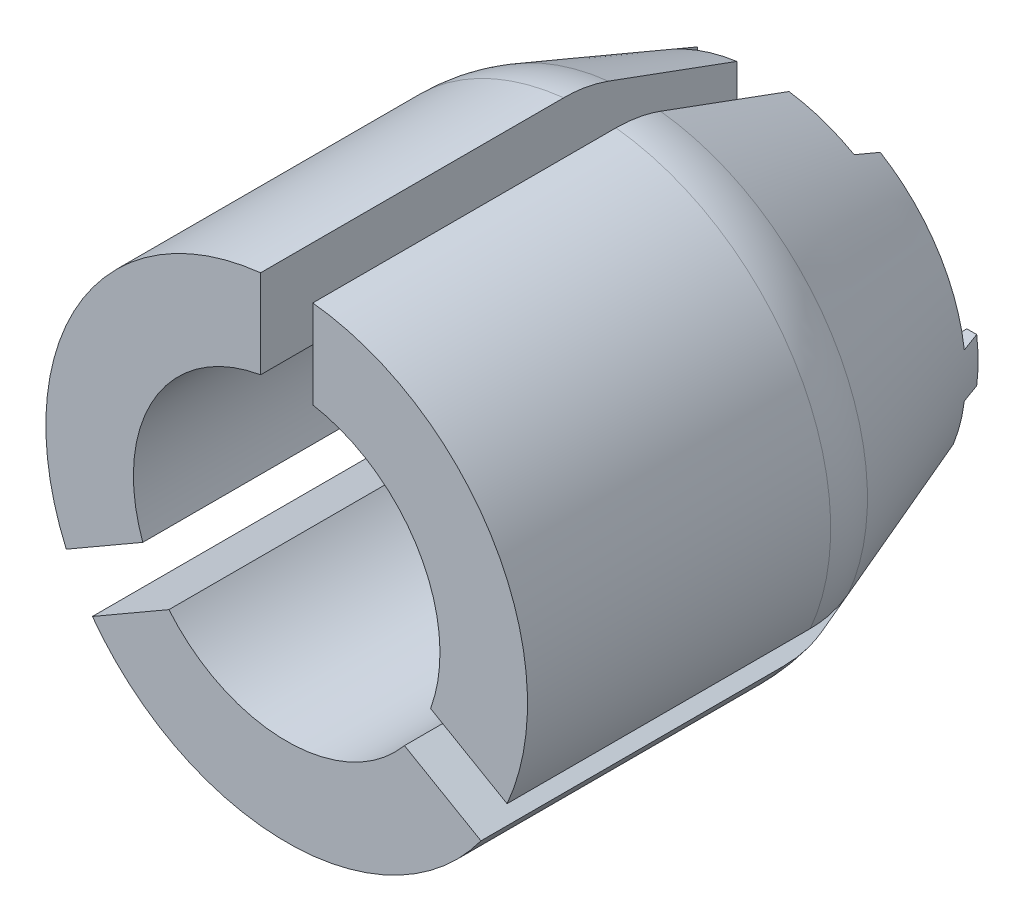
ISO-10303-21;
HEADER;
FILE_DESCRIPTION(('STEP AP214'),'2;1');
FILE_NAME('part.step','',(''),(''),'','','');
FILE_SCHEMA(('AUTOMOTIVE_DESIGN { 1 0 10303 214 1 1 1 1 }'));
ENDSEC;
DATA;
#1=APPLICATION_CONTEXT('core data for automotive mechanical design processes');
#2=APPLICATION_PROTOCOL_DEFINITION('international standard','automotive_design',2000,#1);
#3=PRODUCT_CONTEXT('',#1,'mechanical');
#4=PRODUCT('Part','Part','',(#3));
#5=PRODUCT_RELATED_PRODUCT_CATEGORY('part','',(#4));
#6=PRODUCT_DEFINITION_FORMATION('','',#4);
#7=PRODUCT_DEFINITION_CONTEXT('part definition',#1,'design');
#8=PRODUCT_DEFINITION('design','',#6,#7);
#9=PRODUCT_DEFINITION_SHAPE('','',#8);
#10=(LENGTH_UNIT() NAMED_UNIT(*) SI_UNIT(.MILLI.,.METRE.));
#11=(NAMED_UNIT(*) PLANE_ANGLE_UNIT() SI_UNIT($,.RADIAN.));
#12=(NAMED_UNIT(*) SI_UNIT($,.STERADIAN.) SOLID_ANGLE_UNIT());
#13=UNCERTAINTY_MEASURE_WITH_UNIT(LENGTH_MEASURE(1.E-05),#10,'distance_accuracy_value','');
#14=(GEOMETRIC_REPRESENTATION_CONTEXT(3) GLOBAL_UNCERTAINTY_ASSIGNED_CONTEXT((#13)) GLOBAL_UNIT_ASSIGNED_CONTEXT((#10,
#11,#12)) REPRESENTATION_CONTEXT('',''));
#15=CARTESIAN_POINT('',(0.,0.,0.));
#16=DIRECTION('',(0.,0.,1.));
#17=DIRECTION('',(1.,0.,0.));
#18=AXIS2_PLACEMENT_3D('',#15,#16,#17);
#19=CARTESIAN_POINT('',(0.,0.,3.5));
#20=DIRECTION('',(0.,0.,-1.));
#21=DIRECTION('',(-1.,0.,0.));
#22=AXIS2_PLACEMENT_3D('',#19,#20,#21);
#23=CYLINDRICAL_SURFACE('',#22,12.25);
#24=CARTESIAN_POINT('',(0.,0.,1.5));
#25=DIRECTION('',(0.,0.,1.));
#26=DIRECTION('',(-1.,0.,0.));
#27=AXIS2_PLACEMENT_3D('',#24,#25,#26);
#28=CIRCLE('',#27,12.25);
#29=CARTESIAN_POINT('',(11.4664643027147,-4.31076517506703,1.5));
#30=VERTEX_POINT('',#29);
#31=CARTESIAN_POINT('',(12.1314673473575,-1.7,1.5));
#32=VERTEX_POINT('',#31);
#33=EDGE_CURVE('E237',#30,#32,#28,.T.);
#34=ORIENTED_EDGE('',*,*,#33,.F.);
#35=DIRECTION('',(0.,0.,-1.));
#36=VECTOR('',#35,1.);
#37=CARTESIAN_POINT('',(11.4664643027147,-4.31076517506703,3.5));
#38=LINE('',#37,#36);
#39=CARTESIAN_POINT('',(11.4664643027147,-4.31076517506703,3.5));
#40=VERTEX_POINT('',#39);
#41=EDGE_CURVE('E271',#30,#40,#38,.F.);
#42=ORIENTED_EDGE('',*,*,#41,.T.);
#43=CARTESIAN_POINT('',(0.,0.,3.5));
#44=DIRECTION('',(0.,0.,-1.));
#45=DIRECTION('',(-1.,0.,0.));
#46=AXIS2_PLACEMENT_3D('',#43,#44,#45);
#47=CIRCLE('',#46,12.25);
#48=CARTESIAN_POINT('',(7.,10.0529846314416,3.5));
#49=VERTEX_POINT('',#48);
#50=EDGE_CURVE('E165',#49,#40,#47,.T.);
#51=ORIENTED_EDGE('',*,*,#50,.F.);
#52=DIRECTION('',(0.,0.,-1.));
#53=VECTOR('',#52,1.);
#54=CARTESIAN_POINT('',(7.,10.0529846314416,3.5));
#55=LINE('',#54,#53);
#56=CARTESIAN_POINT('',(7.,10.0529846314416,1.5));
#57=VERTEX_POINT('',#56);
#58=EDGE_CURVE('E267',#49,#57,#55,.T.);
#59=ORIENTED_EDGE('',*,*,#58,.T.);
#60=CARTESIAN_POINT('',(0.,0.,1.5));
#61=DIRECTION('',(0.,0.,1.));
#62=DIRECTION('',(-1.,0.,0.));
#63=AXIS2_PLACEMENT_3D('',#60,#61,#62);
#64=CIRCLE('',#63,12.25);
#65=CARTESIAN_POINT('',(12.1314673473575,1.7,1.5));
#66=VERTEX_POINT('',#65);
#67=EDGE_CURVE('E243',#66,#57,#64,.T.);
#68=ORIENTED_EDGE('',*,*,#67,.F.);
#69=DIRECTION('',(0.,0.,-1.));
#70=VECTOR('',#69,1.);
#71=CARTESIAN_POINT('',(12.1314673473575,1.7,1.5));
#72=LINE('',#71,#70);
#73=CARTESIAN_POINT('',(12.1314673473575,1.7,0.));
#74=VERTEX_POINT('',#73);
#75=EDGE_CURVE('E238',#66,#74,#72,.T.);
#76=ORIENTED_EDGE('',*,*,#75,.T.);
#77=CARTESIAN_POINT('',(0.,0.,0.));
#78=DIRECTION('',(0.,0.,-1.));
#79=DIRECTION('',(-1.,0.,0.));
#80=AXIS2_PLACEMENT_3D('',#77,#78,#79);
#81=CIRCLE('',#80,12.25);
#82=CARTESIAN_POINT('',(12.1314673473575,-1.7,0.));
#83=VERTEX_POINT('',#82);
#84=EDGE_CURVE('E235',#74,#83,#81,.T.);
#85=ORIENTED_EDGE('',*,*,#84,.T.);
#86=DIRECTION('',(0.,0.,-1.));
#87=VECTOR('',#86,1.);
#88=CARTESIAN_POINT('',(12.1314673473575,-1.7,1.5));
#89=LINE('',#88,#87);
#90=EDGE_CURVE('E144',#32,#83,#89,.T.);
#91=ORIENTED_EDGE('',*,*,#90,.F.);
#92=EDGE_LOOP('',(#34,#42,#51,#59,#68,#76,#85,#91));
#93=FACE_BOUND('',#92,.T.);
#94=ADVANCED_FACE('F37',(#93),#23,.F.);
#95=CARTESIAN_POINT('',(0.,0.,1.5));
#96=DIRECTION('',(0.,0.,-1.));
#97=DIRECTION('',(-1.,0.,0.));
#98=AXIS2_PLACEMENT_3D('',#95,#96,#97);
#99=PLANE('',#98);
#100=DIRECTION('',(0.866025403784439,-0.5,0.));
#101=VECTOR('',#100,1.);
#102=CARTESIAN_POINT('',(1.,1.73205080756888,1.5));
#103=LINE('',#102,#101);
#104=CARTESIAN_POINT('',(12.6025721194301,-4.96669732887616,1.5));
#105=VERTEX_POINT('',#104);
#106=EDGE_CURVE('E215',#30,#105,#103,.T.);
#107=ORIENTED_EDGE('',*,*,#106,.F.);
#108=ORIENTED_EDGE('',*,*,#33,.T.);
#109=DIRECTION('',(1.,0.,0.));
#110=VECTOR('',#109,1.);
#111=CARTESIAN_POINT('',(12.1314673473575,-1.7,1.5));
#112=LINE('',#111,#110);
#113=CARTESIAN_POINT('',(13.4388580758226,-1.7,1.5));
#114=VERTEX_POINT('',#113);
#115=EDGE_CURVE('E246',#32,#114,#112,.T.);
#116=ORIENTED_EDGE('',*,*,#115,.T.);
#117=CARTESIAN_POINT('',(0.,0.,1.5));
#118=DIRECTION('',(0.,0.,-1.));
#119=DIRECTION('',(-1.,0.,0.));
#120=AXIS2_PLACEMENT_3D('',#117,#118,#119);
#121=CIRCLE('',#120,13.5459553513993);
#122=EDGE_CURVE('E177',#114,#105,#121,.T.);
#123=ORIENTED_EDGE('',*,*,#122,.T.);
#124=EDGE_LOOP('',(#107,#108,#116,#123));
#125=FACE_BOUND('',#124,.T.);
#126=ADVANCED_FACE('F326',(#125),#99,.T.);
#127=CARTESIAN_POINT('',(0.,0.,0.));
#128=DIRECTION('',(0.,0.,1.));
#129=DIRECTION('',(1.,0.,0.));
#130=AXIS2_PLACEMENT_3D('',#127,#128,#129);
#131=CONICAL_SURFACE('',#130,13.,0.349065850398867);
#132=CARTESIAN_POINT('',(0.,0.,13.343068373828));
#133=DIRECTION('',(0.,0.,-1.));
#134=DIRECTION('',(-1.,0.,0.));
#135=AXIS2_PLACEMENT_3D('',#132,#133,#134);
#136=CIRCLE('',#135,17.8564797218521);
#137=CARTESIAN_POINT('',(2.,17.7441220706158,13.343068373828));
#138=VERTEX_POINT('',#137);
#139=CARTESIAN_POINT('',(16.3668604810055,-7.14001022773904,13.343068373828));
#140=VERTEX_POINT('',#139);
#141=EDGE_CURVE('E174',#138,#140,#136,.T.);
#142=ORIENTED_EDGE('',*,*,#141,.T.);
#143=CARTESIAN_POINT('',(16.366923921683,-7.14004685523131,13.343268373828));
#144=CARTESIAN_POINT('',(16.0141048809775,-6.93634668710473,12.230999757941));
#145=CARTESIAN_POINT('',(15.6611578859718,-6.73257264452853,11.1187852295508));
#146=CARTESIAN_POINT('',(14.9549292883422,-6.32483137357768,8.89449808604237));
#147=CARTESIAN_POINT('',(14.6016476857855,-6.12086414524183,7.78242547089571));
#148=CARTESIAN_POINT('',(13.8946710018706,-5.71269096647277,5.55845534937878));
#149=CARTESIAN_POINT('',(13.5409759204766,-5.5084850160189,4.44655784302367));
#150=CARTESIAN_POINT('',(12.8330436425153,-5.09976012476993,2.2229927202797));
#151=CARTESIAN_POINT('',(12.4788064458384,-4.89524118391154,1.1113251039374));
#152=CARTESIAN_POINT('',(12.1242339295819,-4.69052864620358,-0.000199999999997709));
#153=B_SPLINE_CURVE_WITH_KNOTS('',3,(#143,#144,#145,#146,#147,#148,#149,#150,#151,#152),
.UNSPECIFIED.,.F.,.F.,(4,2,2,2,4),(0.,3.553596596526,7.1071924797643,10.6607886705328,
14.2143855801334),.UNSPECIFIED.);
#154=EDGE_CURVE('E80',#140,#105,#153,.T.);
#155=ORIENTED_EDGE('',*,*,#154,.T.);
#156=ORIENTED_EDGE('',*,*,#122,.F.);
#157=CARTESIAN_POINT('',(17.3471832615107,-1.7,12.1721026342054));
#158=CARTESIAN_POINT('',(16.9966397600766,-1.7,11.2135860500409));
#159=CARTESIAN_POINT('',(16.6460089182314,-1.7,10.2551014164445));
#160=CARTESIAN_POINT('',(15.9445312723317,-1.7,8.33821111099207));
#161=CARTESIAN_POINT('',(15.5936844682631,-1.7,7.37980543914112));
#162=CARTESIAN_POINT('',(14.5407589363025,-1.7,4.50473149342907));
#163=CARTESIAN_POINT('',(13.8382944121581,-1.7,2.58820443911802));
#164=CARTESIAN_POINT('',(12.7833883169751,-1.7,-0.286143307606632));
#165=CARTESIAN_POINT('',(12.4315512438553,-1.7,-1.24418584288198));
#166=CARTESIAN_POINT('',(11.7273517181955,-1.7,-3.16007770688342));
#167=CARTESIAN_POINT('',(11.3749892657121,-1.7,-4.11792703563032));
#168=CARTESIAN_POINT('',(10.6695835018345,-1.7,-6.03337607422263));
#169=CARTESIAN_POINT('',(10.3165401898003,-1.7,-6.99097578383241));
#170=CARTESIAN_POINT('',(9.6095058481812,-1.7,-8.9058256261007));
#171=CARTESIAN_POINT('',(9.25551481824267,-1.7,-9.86307575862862));
#172=CARTESIAN_POINT('',(8.90091646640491,-1.7,-10.8201012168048));
#173=B_SPLINE_CURVE_WITH_KNOTS('',3,(#157,#158,#159,#160,#161,#162,#163,#164,#165,#166,#167,
#168,#169,#170,#171,#172),.UNSPECIFIED.,.F.,.F.,(4,2,2,2,2,2,2,4),(0.,3.06181530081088,
6.12363080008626,12.24725588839,15.3090711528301,18.3708860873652,21.4327039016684,
24.4945228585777),.UNSPECIFIED.);
#174=CARTESIAN_POINT('',(12.8883668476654,-1.7,0.));
#175=VERTEX_POINT('',#174);
#176=EDGE_CURVE('E229',#114,#175,#173,.T.);
#177=ORIENTED_EDGE('',*,*,#176,.T.);
#178=CARTESIAN_POINT('',(0.,0.,0.));
#179=DIRECTION('',(0.,0.,1.));
#180=DIRECTION('',(1.,0.,0.));
#181=AXIS2_PLACEMENT_3D('',#178,#179,#180);
#182=CIRCLE('',#181,13.);
#183=CARTESIAN_POINT('',(12.8883668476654,1.7,0.));
#184=VERTEX_POINT('',#183);
#185=EDGE_CURVE('E232',#175,#184,#182,.T.);
#186=ORIENTED_EDGE('',*,*,#185,.T.);
#187=CARTESIAN_POINT('',(8.90091646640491,1.7,-10.8201012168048));
#188=CARTESIAN_POINT('',(9.25551481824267,1.7,-9.86307575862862));
#189=CARTESIAN_POINT('',(9.6095058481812,1.7,-8.9058256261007));
#190=CARTESIAN_POINT('',(10.3165401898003,1.7,-6.99097578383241));
#191=CARTESIAN_POINT('',(10.6695835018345,1.7,-6.03337607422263));
#192=CARTESIAN_POINT('',(11.3749892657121,1.7,-4.11792703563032));
#193=CARTESIAN_POINT('',(11.7273517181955,1.7,-3.16007770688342));
#194=CARTESIAN_POINT('',(12.4315512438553,1.7,-1.24418584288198));
#195=CARTESIAN_POINT('',(12.7833883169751,1.7,-0.286143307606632));
#196=CARTESIAN_POINT('',(13.8382944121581,1.7,2.58820443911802));
#197=CARTESIAN_POINT('',(14.5407589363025,1.7,4.50473149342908));
#198=CARTESIAN_POINT('',(15.5936844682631,1.7,7.37980543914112));
#199=CARTESIAN_POINT('',(15.9445312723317,1.7,8.33821111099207));
#200=CARTESIAN_POINT('',(16.6460089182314,1.7,10.2551014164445));
#201=CARTESIAN_POINT('',(16.9966397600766,1.7,11.2135860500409));
#202=CARTESIAN_POINT('',(17.3471832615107,1.7,12.1721026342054));
#203=B_SPLINE_CURVE_WITH_KNOTS('',3,(#187,#188,#189,#190,#191,#192,#193,#194,#195,#196,#197,
#198,#199,#200,#201,#202),.UNSPECIFIED.,.F.,.F.,(4,2,2,2,2,2,2,4),(0.,3.06181895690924,
6.12363677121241,9.18545170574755,12.2472669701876,18.3708920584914,21.4327075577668,
24.4945228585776),.UNSPECIFIED.);
#204=CARTESIAN_POINT('',(13.4388580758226,1.7,1.5));
#205=VERTEX_POINT('',#204);
#206=EDGE_CURVE('E185',#184,#205,#203,.T.);
#207=ORIENTED_EDGE('',*,*,#206,.T.);
#208=CARTESIAN_POINT('',(0.,0.,1.5));
#209=DIRECTION('',(0.,0.,-1.));
#210=DIRECTION('',(-1.,0.,0.));
#211=AXIS2_PLACEMENT_3D('',#208,#209,#210);
#212=CIRCLE('',#211,13.5459553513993);
#213=CARTESIAN_POINT('',(7.,11.5971076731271,1.5));
#214=VERTEX_POINT('',#213);
#215=EDGE_CURVE('E239',#214,#205,#212,.T.);
#216=ORIENTED_EDGE('',*,*,#215,.F.);
#217=CARTESIAN_POINT('',(7.,-19.6291767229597,21.5401556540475));
#218=CARTESIAN_POINT('',(7.,-19.3988615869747,20.9441395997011));
#219=CARTESIAN_POINT('',(7.,-19.1681520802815,20.3482759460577));
#220=CARTESIAN_POINT('',(7.,-18.7058473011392,19.1568917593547));
#221=CARTESIAN_POINT('',(7.,-18.4742520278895,18.5613712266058));
#222=CARTESIAN_POINT('',(7.,-17.7779749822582,16.7753380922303));
#223=CARTESIAN_POINT('',(7.,-17.3118194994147,15.5853993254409));
#224=CARTESIAN_POINT('',(7.,-16.3737448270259,13.205409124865));
#225=CARTESIAN_POINT('',(7.,-15.9018170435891,12.0153610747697));
#226=CARTESIAN_POINT('',(7.,-14.9515589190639,9.63785907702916));
#227=CARTESIAN_POINT('',(7.,-14.4732287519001,8.45040505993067));
#228=CARTESIAN_POINT('',(7.,-13.4964177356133,6.05024495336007));
#229=CARTESIAN_POINT('',(7.,-12.9977293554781,4.83762303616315));
#230=CARTESIAN_POINT('',(7.,-12.2404200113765,3.02249782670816));
#231=CARTESIAN_POINT('',(7.,-11.986426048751,2.41806417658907));
#232=CARTESIAN_POINT('',(7.,-11.4747223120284,1.21077230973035));
#233=CARTESIAN_POINT('',(7.,-11.2170125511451,0.607914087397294));
#234=CARTESIAN_POINT('',(7.,-10.6973239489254,-0.59533258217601));
#235=CARTESIAN_POINT('',(7.,-10.4353490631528,-1.19572273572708));
#236=CARTESIAN_POINT('',(7.,-9.90587230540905,-2.39405987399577));
#237=CARTESIAN_POINT('',(7.,-9.63837048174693,-2.99200688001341));
#238=CARTESIAN_POINT('',(7.,-9.09646374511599,-4.18467024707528));
#239=CARTESIAN_POINT('',(7.,-8.82205979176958,-4.77938704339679));
#240=CARTESIAN_POINT('',(7.,-8.26436456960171,-5.96463042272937));
#241=CARTESIAN_POINT('',(7.,-7.98107369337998,-6.55515718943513));
#242=CARTESIAN_POINT('',(7.,-7.55800689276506,-7.41479923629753));
#243=CARTESIAN_POINT('',(7.,-7.42286848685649,-7.68619807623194));
#244=CARTESIAN_POINT('',(7.,-7.14965449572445,-8.22752002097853));
#245=CARTESIAN_POINT('',(7.,-7.01157887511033,-8.49744310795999));
#246=CARTESIAN_POINT('',(7.,-6.73194430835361,-9.03566196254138));
#247=CARTESIAN_POINT('',(7.,-6.59038356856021,-9.30395679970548));
#248=CARTESIAN_POINT('',(7.,-6.30324991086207,-9.83838996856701));
#249=CARTESIAN_POINT('',(7.,-6.15767705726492,-10.1045283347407));
#250=CARTESIAN_POINT('',(7.,-5.86163018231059,-10.6343661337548));
#251=CARTESIAN_POINT('',(7.,-5.71115213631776,-10.8980633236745));
#252=CARTESIAN_POINT('',(7.,-5.4044280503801,-11.4220784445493));
#253=CARTESIAN_POINT('',(7.,-5.24818226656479,-11.6823965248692));
#254=CARTESIAN_POINT('',(7.,-4.92873183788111,-12.1984615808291));
#255=CARTESIAN_POINT('',(7.,-4.76553276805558,-12.4542119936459));
#256=CARTESIAN_POINT('',(7.,-4.43032534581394,-12.959846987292));
#257=CARTESIAN_POINT('',(7.,-4.25831878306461,-13.2097327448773));
#258=CARTESIAN_POINT('',(7.,-3.9374060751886,-13.653769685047));
#259=CARTESIAN_POINT('',(7.,-3.79047674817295,-13.8493431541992));
#260=CARTESIAN_POINT('',(7.,-3.48738085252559,-14.2334619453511));
#261=CARTESIAN_POINT('',(7.,-3.33120862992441,-14.4220028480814));
#262=CARTESIAN_POINT('',(7.,-3.00825692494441,-14.7879793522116));
#263=CARTESIAN_POINT('',(7.,-2.84154237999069,-14.9654716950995));
#264=CARTESIAN_POINT('',(7.,-2.49382772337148,-15.3056980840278));
#265=CARTESIAN_POINT('',(7.,-2.31284853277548,-15.4684530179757));
#266=CARTESIAN_POINT('',(7.,-1.97896799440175,-15.7346270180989));
#267=CARTESIAN_POINT('',(7.,-1.82994980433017,-15.8428477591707));
#268=CARTESIAN_POINT('',(7.,-1.51986241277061,-16.0411298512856));
#269=CARTESIAN_POINT('',(7.,-1.35878244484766,-16.1311747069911));
#270=CARTESIAN_POINT('',(7.,-1.02153987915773,-16.2865498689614));
#271=CARTESIAN_POINT('',(7.,-0.845185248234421,-16.3514837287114));
#272=CARTESIAN_POINT('',(7.,-0.573972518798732,-16.4219111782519));
#273=CARTESIAN_POINT('',(7.,-0.482545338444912,-16.4408861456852));
#274=CARTESIAN_POINT('',(7.,-0.29817828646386,-16.4690797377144));
#275=CARTESIAN_POINT('',(7.,-0.205238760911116,-16.4783005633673));
#276=CARTESIAN_POINT('',(7.,-0.0305066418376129,-16.4859885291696));
#277=CARTESIAN_POINT('',(7.,0.0512350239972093,-16.4856502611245));
#278=CARTESIAN_POINT('',(7.,0.214323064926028,-16.4771595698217));
#279=CARTESIAN_POINT('',(7.,0.295669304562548,-16.4690046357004));
#280=CARTESIAN_POINT('',(7.,0.538162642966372,-16.4331884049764));
#281=CARTESIAN_POINT('',(7.,0.697705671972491,-16.3941734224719));
#282=CARTESIAN_POINT('',(7.,1.04905238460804,-16.2774876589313));
#283=CARTESIAN_POINT('',(7.,1.23829984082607,-16.1923471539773));
#284=CARTESIAN_POINT('',(7.,1.51038253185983,-16.04378973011));
#285=CARTESIAN_POINT('',(7.,1.59922460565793,-15.9907098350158));
#286=CARTESIAN_POINT('',(7.,1.77320282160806,-15.8787626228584));
#287=CARTESIAN_POINT('',(7.,1.85833924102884,-15.8198957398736));
#288=CARTESIAN_POINT('',(7.,2.04365365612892,-15.6838082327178));
#289=CARTESIAN_POINT('',(7.,2.14296581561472,-15.6054174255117));
#290=CARTESIAN_POINT('',(7.,2.33690698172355,-15.4430156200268));
#291=CARTESIAN_POINT('',(7.,2.4315341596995,-15.3590024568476));
#292=CARTESIAN_POINT('',(7.,2.70942699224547,-15.1000541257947));
#293=CARTESIAN_POINT('',(7.,2.88643913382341,-14.9184131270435));
#294=CARTESIAN_POINT('',(7.,3.22853677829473,-14.5422296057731));
#295=CARTESIAN_POINT('',(7.,3.39353394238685,-14.3476084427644));
#296=CARTESIAN_POINT('',(7.,3.63316911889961,-14.0495729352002));
#297=CARTESIAN_POINT('',(7.,3.71170456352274,-13.9492559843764));
#298=CARTESIAN_POINT('',(7.,3.86645872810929,-13.7468559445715));
#299=CARTESIAN_POINT('',(7.,3.94267752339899,-13.6447729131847));
#300=CARTESIAN_POINT('',(7.,4.18073809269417,-13.3191871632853));
#301=CARTESIAN_POINT('',(7.,4.33878473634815,-13.0929065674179));
#302=CARTESIAN_POINT('',(7.,4.64721285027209,-12.6351609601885));
#303=CARTESIAN_POINT('',(7.,4.79759278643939,-12.4036949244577));
#304=CARTESIAN_POINT('',(7.,5.09219649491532,-11.936684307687));
#305=CARTESIAN_POINT('',(7.,5.23641629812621,-11.701137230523));
#306=CARTESIAN_POINT('',(7.,5.5196978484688,-11.2269534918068));
#307=CARTESIAN_POINT('',(7.,5.65875928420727,-10.9883166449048));
#308=CARTESIAN_POINT('',(7.,5.93290787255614,-10.5079639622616));
#309=CARTESIAN_POINT('',(7.,6.06798390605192,-10.2662417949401));
#310=CARTESIAN_POINT('',(7.,6.33444822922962,-9.78077048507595));
#311=CARTESIAN_POINT('',(7.,6.46583642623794,-9.53702129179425));
#312=CARTESIAN_POINT('',(7.,6.85518167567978,-8.80346796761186));
#313=CARTESIAN_POINT('',(7.,7.10842917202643,-8.31116349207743));
#314=CARTESIAN_POINT('',(7.,7.60602568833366,-7.32069234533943));
#315=CARTESIAN_POINT('',(7.,7.85035291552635,-6.82251480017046));
#316=CARTESIAN_POINT('',(7.,8.3316133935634,-5.82255566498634));
#317=CARTESIAN_POINT('',(7.,8.56854600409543,-5.32077376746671));
#318=CARTESIAN_POINT('',(7.,9.03613508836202,-4.315255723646));
#319=CARTESIAN_POINT('',(7.,9.26680079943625,-3.81152386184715));
#320=CARTESIAN_POINT('',(7.,9.72333445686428,-2.80191117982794));
#321=CARTESIAN_POINT('',(7.,9.94920253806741,-2.29603042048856));
#322=CARTESIAN_POINT('',(7.,10.3869894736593,-1.30513617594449));
#323=CARTESIAN_POINT('',(7.,10.599081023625,-0.820198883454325));
#324=CARTESIAN_POINT('',(7.,11.0202107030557,0.151000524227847));
#325=CARTESIAN_POINT('',(7.,11.2292488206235,0.637262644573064));
#326=CARTESIAN_POINT('',(7.,11.8524869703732,2.09772692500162));
#327=CARTESIAN_POINT('',(7.,12.2628020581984,3.07358710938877));
#328=CARTESIAN_POINT('',(7.,13.0759911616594,5.02919079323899));
#329=CARTESIAN_POINT('',(7.,13.4788597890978,6.00893652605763));
#330=CARTESIAN_POINT('',(7.,14.2786278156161,7.97086375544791));
#331=CARTESIAN_POINT('',(7.,14.6755271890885,8.95304526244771));
#332=CARTESIAN_POINT('',(7.,15.4572005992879,10.9008135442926));
#333=CARTESIAN_POINT('',(7.,15.8420623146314,11.8663651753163));
#334=CARTESIAN_POINT('',(7.,16.6081245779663,13.7989233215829));
#335=CARTESIAN_POINT('',(7.,16.9893251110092,14.7659298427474));
#336=CARTESIAN_POINT('',(7.,17.7483908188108,16.7002577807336));
#337=CARTESIAN_POINT('',(7.,18.1262586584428,17.6675781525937));
#338=CARTESIAN_POINT('',(7.,18.8794811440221,19.6031874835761));
#339=CARTESIAN_POINT('',(7.,19.2548358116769,20.5714764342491));
#340=CARTESIAN_POINT('',(7.,19.6291767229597,21.5401556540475));
#341=B_SPLINE_CURVE_WITH_KNOTS('',3,(#217,#218,#219,#220,#221,#222,#223,#224,#225,#226,#227,
#228,#229,#230,#231,#232,#233,#234,#235,#236,#237,#238,#239,#240,#241,#242,#243,#244,#245,#246,
#247,#248,#249,#250,#251,#252,#253,#254,#255,#256,#257,#258,#259,#260,#261,#262,#263,#264,#265,
#266,#267,#268,#269,#270,#271,#272,#273,#274,#275,#276,#277,#278,#279,#280,#281,#282,#283,#284,
#285,#286,#287,#288,#289,#290,#291,#292,#293,#294,#295,#296,#297,#298,#299,#300,#301,#302,#303,
#304,#305,#306,#307,#308,#309,#310,#311,#312,#313,#314,#315,#316,#317,#318,#319,#320,#321,#322,
#323,#324,#325,#326,#327,#328,#329,#330,#331,#332,#333,#334,#335,#336,#337,#338,#339,#340),
.UNSPECIFIED.,.F.,.F.,(4,2,2,2,2,2,2,2,2,2,2,2,2,2,2,2,2,2,2,2,2,2,2,2,2,2,2,2,2,2,2,2,2,2,2,2,
2,2,2,2,2,2,2,2,2,2,2,2,2,2,2,2,2,2,2,2,2,2,2,2,2,4),(0.,1.91690398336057,3.83380969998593,
7.66776703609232,11.5083736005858,15.3488760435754,19.2823009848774,21.2491866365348,
23.2160652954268,25.1812134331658,27.1463444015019,29.1112036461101,31.0759762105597,
31.9855101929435,32.8950551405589,33.8050784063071,34.7150870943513,35.6258622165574,
36.5365969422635,37.4466147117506,38.3564482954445,39.0900944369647,39.8241940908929,
40.5541448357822,41.2830442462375,41.8345847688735,42.3866236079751,42.9470530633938,
43.2267338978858,43.5063516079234,43.7512004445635,43.9961279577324,44.4861562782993,
45.1051127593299,45.4154349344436,45.7257338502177,46.1050444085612,46.4845018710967,
47.244413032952,48.0094413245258,48.3916190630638,48.7737843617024,49.6015867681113,
50.4295541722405,51.2580472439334,52.086590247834,52.9172602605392,53.7479511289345,
55.4086627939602,57.0731918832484,58.7378647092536,60.3999336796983,62.0619558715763,
63.6498111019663,65.2376725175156,68.4134605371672,71.5914630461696,74.7694791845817,
77.8877513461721,81.0060362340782,84.1215477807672,87.2370323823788),.UNSPECIFIED.);
#342=CARTESIAN_POINT('',(7.,12.4396182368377,3.5));
#343=VERTEX_POINT('',#342);
#344=EDGE_CURVE('E178',#214,#343,#341,.T.);
#345=ORIENTED_EDGE('',*,*,#344,.T.);
#346=CARTESIAN_POINT('',(0.,0.,3.5));
#347=DIRECTION('',(0.,0.,-1.));
#348=DIRECTION('',(-1.,0.,0.));
#349=AXIS2_PLACEMENT_3D('',#346,#347,#348);
#350=CIRCLE('',#349,14.2738958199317);
#351=CARTESIAN_POINT('',(2.,14.1330853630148,3.5));
#352=VERTEX_POINT('',#351);
#353=EDGE_CURVE('E169',#352,#343,#350,.T.);
#354=ORIENTED_EDGE('',*,*,#353,.F.);
#355=CARTESIAN_POINT('',(2.,6.41526344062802,-17.2547295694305));
#356=CARTESIAN_POINT('',(2.,6.56390800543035,-16.8648244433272));
#357=CARTESIAN_POINT('',(2.,6.7121636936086,-16.4747713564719));
#358=CARTESIAN_POINT('',(2.,7.0080167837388,-15.6944159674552));
#359=CARTESIAN_POINT('',(2.,7.15561418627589,-15.3041136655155));
#360=CARTESIAN_POINT('',(2.,7.59759766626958,-14.1329043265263));
#361=CARTESIAN_POINT('',(2.,7.89117591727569,-13.3516924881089));
#362=CARTESIAN_POINT('',(2.,8.476797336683,-11.7887002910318));
#363=CARTESIAN_POINT('',(2.,8.76884051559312,-11.006919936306));
#364=CARTESIAN_POINT('',(2.,9.35178663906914,-9.44293356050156));
#365=CARTESIAN_POINT('',(2.,9.64268958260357,-8.6607275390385));
#366=CARTESIAN_POINT('',(2.,10.533850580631,-6.26048030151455));
#367=CARTESIAN_POINT('',(2.,11.1327080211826,-4.64191919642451));
#368=CARTESIAN_POINT('',(2.,12.3282153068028,-1.40397856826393));
#369=CARTESIAN_POINT('',(2.,12.9248651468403,0.215400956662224));
#370=CARTESIAN_POINT('',(2.,14.10690648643,3.42807582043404));
#371=CARTESIAN_POINT('',(2.,14.6923218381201,5.02136238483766));
#372=CARTESIAN_POINT('',(2.,15.8621656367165,8.20829774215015));
#373=CARTESIAN_POINT('',(2.,16.4465940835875,9.801946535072));
#374=CARTESIAN_POINT('',(2.,18.1988245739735,14.5832760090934));
#375=CARTESIAN_POINT('',(2.,19.3655728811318,17.7713428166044));
#376=CARTESIAN_POINT('',(2.,21.593649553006,23.8641314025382));
#377=CARTESIAN_POINT('',(2.,22.6551132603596,26.7688037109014));
#378=CARTESIAN_POINT('',(2.,24.7771645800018,32.5784684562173));
#379=CARTESIAN_POINT('',(2.,25.8377521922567,35.4834608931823));
#380=CARTESIAN_POINT('',(2.,27.9583314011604,41.2936645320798));
#381=CARTESIAN_POINT('',(2.,29.0183229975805,44.1988757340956));
#382=CARTESIAN_POINT('',(2.,31.1378659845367,50.0094584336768));
#383=CARTESIAN_POINT('',(2.,32.1974173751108,52.9148299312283));
#384=CARTESIAN_POINT('',(2.,33.2568268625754,55.8202531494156));
#385=B_SPLINE_CURVE_WITH_KNOTS('',3,(#355,#356,#357,#358,#359,#360,#361,#362,#363,#364,#365,
#366,#367,#368,#369,#370,#371,#372,#373,#374,#375,#376,#377,#378,#379,#380,#381,#382,#383,#384),
.UNSPECIFIED.,.F.,.F.,(4,2,2,2,2,2,2,2,2,2,2,2,2,2,4),(0.,1.25183440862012,2.50366770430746,
5.00732669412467,7.51096852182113,10.0146126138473,15.1919960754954,20.3693913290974,
25.4616848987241,30.5539786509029,40.7385564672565,50.0161873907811,59.2938186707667,
68.5714535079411,77.8490875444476),.UNSPECIFIED.);
#386=EDGE_CURVE('E171',#352,#138,#385,.T.);
#387=ORIENTED_EDGE('',*,*,#386,.T.);
#388=EDGE_LOOP('',(#142,#155,#156,#177,#186,#207,#216,#345,#354,#387));
#389=FACE_BOUND('',#388,.T.);
#390=ADVANCED_FACE('F39',(#389),#131,.T.);
#391=CARTESIAN_POINT('',(0.,0.,3.5));
#392=DIRECTION('',(0.,0.,-1.));
#393=DIRECTION('',(-1.,0.,0.));
#394=AXIS2_PLACEMENT_3D('',#391,#392,#393);
#395=PLANE('',#394);
#396=DIRECTION('',(0.866025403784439,-0.5,0.));
#397=VECTOR('',#396,1.);
#398=CARTESIAN_POINT('',(1.,1.73205080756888,3.5));
#399=LINE('',#398,#397);
#400=CARTESIAN_POINT('',(11.0273064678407,-4.05721728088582,3.5));
#401=VERTEX_POINT('',#400);
#402=EDGE_CURVE('E274',#401,#40,#399,.T.);
#403=ORIENTED_EDGE('',*,*,#402,.F.);
#404=CARTESIAN_POINT('',(0.,0.,3.5));
#405=DIRECTION('',(0.,0.,-1.));
#406=DIRECTION('',(-1.,0.,0.));
#407=AXIS2_PLACEMENT_3D('',#404,#405,#406);
#408=CIRCLE('',#407,11.75);
#409=CARTESIAN_POINT('',(2.,11.5785361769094,3.5));
#410=VERTEX_POINT('',#409);
#411=EDGE_CURVE('E163',#410,#401,#408,.T.);
#412=ORIENTED_EDGE('',*,*,#411,.F.);
#413=DIRECTION('',(0.,-1.,0.));
#414=VECTOR('',#413,1.);
#415=CARTESIAN_POINT('',(2.,0.,3.5));
#416=LINE('',#415,#414);
#417=EDGE_CURVE('E139',#352,#410,#416,.T.);
#418=ORIENTED_EDGE('',*,*,#417,.F.);
#419=ORIENTED_EDGE('',*,*,#353,.T.);
#420=DIRECTION('',(0.,-1.,0.));
#421=VECTOR('',#420,1.);
#422=CARTESIAN_POINT('',(7.,15.,3.5));
#423=LINE('',#422,#421);
#424=EDGE_CURVE('E166',#343,#49,#423,.T.);
#425=ORIENTED_EDGE('',*,*,#424,.T.);
#426=ORIENTED_EDGE('',*,*,#50,.T.);
#427=EDGE_LOOP('',(#403,#412,#418,#419,#425,#426));
#428=FACE_BOUND('',#427,.T.);
#429=ADVANCED_FACE('F280',(#428),#395,.T.);
#430=CARTESIAN_POINT('',(0.,0.,15.));
#431=DIRECTION('',(0.,0.,-1.));
#432=DIRECTION('',(-1.,0.,0.));
#433=AXIS2_PLACEMENT_3D('',#430,#431,#432);
#434=CYLINDRICAL_SURFACE('',#433,11.75);
#435=ORIENTED_EDGE('',*,*,#411,.T.);
#436=DIRECTION('',(0.,0.,-1.));
#437=VECTOR('',#436,1.);
#438=CARTESIAN_POINT('',(11.0273064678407,-4.05721728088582,15.));
#439=LINE('',#438,#437);
#440=CARTESIAN_POINT('',(11.0273064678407,-4.05721728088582,40.));
#441=VERTEX_POINT('',#440);
#442=EDGE_CURVE('E56',#401,#441,#439,.F.);
#443=ORIENTED_EDGE('',*,*,#442,.T.);
#444=CARTESIAN_POINT('',(0.,0.,40.));
#445=DIRECTION('',(0.,0.,-1.));
#446=DIRECTION('',(1.,0.,0.));
#447=AXIS2_PLACEMENT_3D('',#444,#445,#446);
#448=CIRCLE('',#447,11.75);
#449=CARTESIAN_POINT('',(2.00000000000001,11.5785361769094,40.));
#450=VERTEX_POINT('',#449);
#451=EDGE_CURVE('E151',#450,#441,#448,.T.);
#452=ORIENTED_EDGE('',*,*,#451,.F.);
#453=DIRECTION('',(0.,0.,-1.));
#454=VECTOR('',#453,1.);
#455=CARTESIAN_POINT('',(2.,11.5785361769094,15.));
#456=LINE('',#455,#454);
#457=EDGE_CURVE('E133',#410,#450,#456,.F.);
#458=ORIENTED_EDGE('',*,*,#457,.F.);
#459=EDGE_LOOP('',(#435,#443,#452,#458));
#460=FACE_BOUND('',#459,.T.);
#461=ADVANCED_FACE('F155',(#460),#434,.F.);
#462=CARTESIAN_POINT('',(0.,0.,40.));
#463=DIRECTION('',(0.,0.,-1.));
#464=DIRECTION('',(-1.,0.,0.));
#465=AXIS2_PLACEMENT_3D('',#462,#463,#464);
#466=CYLINDRICAL_SURFACE('',#465,18.4595535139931);
#467=CARTESIAN_POINT('',(0.,0.,40.));
#468=DIRECTION('',(0.,0.,1.));
#469=DIRECTION('',(1.,0.,0.));
#470=AXIS2_PLACEMENT_3D('',#467,#468,#469);
#471=CIRCLE('',#470,18.4595535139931);
#472=CARTESIAN_POINT('',(16.8923357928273,-7.44339354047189,40.));
#473=VERTEX_POINT('',#472);
#474=CARTESIAN_POINT('',(2.,18.3508886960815,40.));
#475=VERTEX_POINT('',#474);
#476=EDGE_CURVE('E42',#473,#475,#471,.T.);
#477=ORIENTED_EDGE('',*,*,#476,.F.);
#478=DIRECTION('',(0.,0.,-1.));
#479=VECTOR('',#478,1.);
#480=CARTESIAN_POINT('',(16.8923357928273,-7.44339354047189,40.));
#481=LINE('',#480,#479);
#482=CARTESIAN_POINT('',(16.8923357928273,-7.44339354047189,16.7632698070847));
#483=VERTEX_POINT('',#482);
#484=EDGE_CURVE('E162',#473,#483,#481,.T.);
#485=ORIENTED_EDGE('',*,*,#484,.T.);
#486=CARTESIAN_POINT('',(0.,0.,16.7632698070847));
#487=DIRECTION('',(0.,0.,-1.));
#488=DIRECTION('',(-1.,0.,0.));
#489=AXIS2_PLACEMENT_3D('',#486,#487,#488);
#490=CIRCLE('',#489,18.4595535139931);
#491=CARTESIAN_POINT('',(2.,18.3508886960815,16.7632698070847));
#492=VERTEX_POINT('',#491);
#493=EDGE_CURVE('E160',#483,#492,#490,.F.);
#494=ORIENTED_EDGE('',*,*,#493,.T.);
#495=DIRECTION('',(0.,0.,-1.));
#496=VECTOR('',#495,1.);
#497=CARTESIAN_POINT('',(2.,18.3508886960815,40.));
#498=LINE('',#497,#496);
#499=EDGE_CURVE('E156',#475,#492,#498,.T.);
#500=ORIENTED_EDGE('',*,*,#499,.F.);
#501=EDGE_LOOP('',(#477,#485,#494,#500));
#502=FACE_BOUND('',#501,.T.);
#503=ADVANCED_FACE('F318',(#502),#466,.T.);
#504=CARTESIAN_POINT('',(0.,0.,40.));
#505=DIRECTION('',(0.,0.,1.));
#506=DIRECTION('',(1.,0.,0.));
#507=AXIS2_PLACEMENT_3D('',#504,#505,#506);
#508=PLANE('',#507);
#509=DIRECTION('',(-0.866025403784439,0.5,0.));
#510=VECTOR('',#509,1.);
#511=CARTESIAN_POINT('',(2.,1.15470053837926,40.));
#512=LINE('',#511,#510);
#513=EDGE_CURVE('E12',#473,#441,#512,.T.);
#514=ORIENTED_EDGE('',*,*,#513,.F.);
#515=ORIENTED_EDGE('',*,*,#476,.T.);
#516=DIRECTION('',(0.,-1.,0.));
#517=VECTOR('',#516,1.);
#518=CARTESIAN_POINT('',(2.,18.3508886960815,40.));
#519=LINE('',#518,#517);
#520=EDGE_CURVE('E137',#475,#450,#519,.T.);
#521=ORIENTED_EDGE('',*,*,#520,.T.);
#522=ORIENTED_EDGE('',*,*,#451,.T.);
#523=EDGE_LOOP('',(#514,#515,#521,#522));
#524=FACE_BOUND('',#523,.T.);
#525=ADVANCED_FACE('F150',(#524),#508,.T.);
#526=CARTESIAN_POINT('',(0.,0.,16.7632698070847));
#527=DIRECTION('',(0.,0.,-1.));
#528=DIRECTION('',(-1.,0.,0.));
#529=AXIS2_PLACEMENT_3D('',#526,#527,#528);
#530=DEGENERATE_TOROIDAL_SURFACE('',#529,8.45955351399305,10.,.T.);
#531=CARTESIAN_POINT('',(16.3667970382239,-7.139973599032,13.3428683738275));
#532=CARTESIAN_POINT('',(16.4538362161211,-7.19022569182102,13.6171480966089));
#533=CARTESIAN_POINT('',(16.5303601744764,-7.23440681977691,13.8958701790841));
#534=CARTESIAN_POINT('',(16.6613983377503,-7.3100617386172,14.457844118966));
#535=CARTESIAN_POINT('',(16.7160762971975,-7.34163007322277,14.7410450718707));
#536=CARTESIAN_POINT('',(16.8037869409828,-7.392269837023,15.3118820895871));
#537=CARTESIAN_POINT('',(16.8368196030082,-7.41134125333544,15.5995181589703));
#538=CARTESIAN_POINT('',(16.8811955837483,-7.43696173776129,16.1792459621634));
#539=CARTESIAN_POINT('',(16.892369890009,-7.44341322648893,16.4713549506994));
#540=CARTESIAN_POINT('',(16.892335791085,-7.44339353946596,16.7634698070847));
#541=B_SPLINE_CURVE_WITH_KNOTS('',3,(#531,#532,#533,#534,#535,#536,#537,#538,#539,#540),
.UNSPECIFIED.,.F.,.F.,(4,2,2,2,4),(0.,0.876048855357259,1.74540189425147,2.61475582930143,
3.49080559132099),.UNSPECIFIED.);
#542=EDGE_CURVE('E48',#140,#483,#541,.T.);
#543=ORIENTED_EDGE('',*,*,#542,.F.);
#544=ORIENTED_EDGE('',*,*,#141,.F.);
#545=CARTESIAN_POINT('',(2.,18.3508886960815,16.7632698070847));
#546=CARTESIAN_POINT('',(2.,18.3509221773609,16.4711897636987));
#547=CARTESIAN_POINT('',(2.,18.3380164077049,16.1791158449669));
#548=CARTESIAN_POINT('',(2.,18.2867759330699,15.5994570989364));
#549=CARTESIAN_POINT('',(2.,18.2486362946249,15.3118550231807));
#550=CARTESIAN_POINT('',(2.,18.1473690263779,14.7410849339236));
#551=CARTESIAN_POINT('',(2.,18.084241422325,14.4579169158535));
#552=CARTESIAN_POINT('',(2.,17.9329556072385,13.8960077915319));
#553=CARTESIAN_POINT('',(2.,17.844608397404,13.6173175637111));
#554=CARTESIAN_POINT('',(2.,17.7441220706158,13.343068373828));
#555=B_SPLINE_CURVE_WITH_KNOTS('',3,(#545,#546,#547,#548,#549,#550,#551,#552,#553,#554),
.UNSPECIFIED.,.F.,.F.,(4,2,2,2,4),(0.,0.875945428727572,1.74519739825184,2.61444847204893,
3.49039299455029),.UNSPECIFIED.);
#556=EDGE_CURVE('E157',#492,#138,#555,.T.);
#557=ORIENTED_EDGE('',*,*,#556,.F.);
#558=ORIENTED_EDGE('',*,*,#493,.F.);
#559=EDGE_LOOP('',(#543,#544,#557,#558));
#560=FACE_BOUND('',#559,.T.);
#561=ADVANCED_FACE('F197',(#560),#530,.T.);
#562=CARTESIAN_POINT('',(2.,25.,15.));
#563=DIRECTION('',(1.,0.,0.));
#564=DIRECTION('',(0.,1.,0.));
#565=AXIS2_PLACEMENT_3D('',#562,#563,#564);
#566=PLANE('',#565);
#567=ORIENTED_EDGE('',*,*,#499,.T.);
#568=ORIENTED_EDGE('',*,*,#556,.T.);
#569=ORIENTED_EDGE('',*,*,#386,.F.);
#570=ORIENTED_EDGE('',*,*,#417,.T.);
#571=ORIENTED_EDGE('',*,*,#457,.T.);
#572=ORIENTED_EDGE('',*,*,#520,.F.);
#573=EDGE_LOOP('',(#567,#568,#569,#570,#571,#572));
#574=FACE_BOUND('',#573,.T.);
#575=ADVANCED_FACE('F136',(#574),#566,.F.);
#576=CARTESIAN_POINT('',(0.,0.,0.));
#577=DIRECTION('',(0.,0.,1.));
#578=DIRECTION('',(1.,0.,0.));
#579=AXIS2_PLACEMENT_3D('',#576,#577,#578);
#580=PLANE('',#579);
#581=ORIENTED_EDGE('',*,*,#84,.F.);
#582=DIRECTION('',(-1.,0.,0.));
#583=VECTOR('',#582,1.);
#584=CARTESIAN_POINT('',(12.1314673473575,1.7,0.));
#585=LINE('',#584,#583);
#586=EDGE_CURVE('E242',#184,#74,#585,.T.);
#587=ORIENTED_EDGE('',*,*,#586,.F.);
#588=ORIENTED_EDGE('',*,*,#185,.F.);
#589=DIRECTION('',(1.,0.,0.));
#590=VECTOR('',#589,1.);
#591=CARTESIAN_POINT('',(12.1314673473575,-1.7,0.));
#592=LINE('',#591,#590);
#593=EDGE_CURVE('E258',#83,#175,#592,.T.);
#594=ORIENTED_EDGE('',*,*,#593,.F.);
#595=EDGE_LOOP('',(#581,#587,#588,#594));
#596=FACE_BOUND('',#595,.T.);
#597=ADVANCED_FACE('F195',(#596),#580,.F.);
#598=CARTESIAN_POINT('',(12.1314673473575,-1.7,1.5));
#599=DIRECTION('',(0.,1.,0.));
#600=DIRECTION('',(-1.,0.,0.));
#601=AXIS2_PLACEMENT_3D('',#598,#599,#600);
#602=PLANE('',#601);
#603=ORIENTED_EDGE('',*,*,#115,.F.);
#604=ORIENTED_EDGE('',*,*,#90,.T.);
#605=ORIENTED_EDGE('',*,*,#593,.T.);
#606=ORIENTED_EDGE('',*,*,#176,.F.);
#607=EDGE_LOOP('',(#603,#604,#605,#606));
#608=FACE_BOUND('',#607,.T.);
#609=ADVANCED_FACE('F300',(#608),#602,.F.);
#610=CARTESIAN_POINT('',(12.1314673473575,1.7,1.5));
#611=DIRECTION('',(0.,-1.,0.));
#612=DIRECTION('',(1.,0.,0.));
#613=AXIS2_PLACEMENT_3D('',#610,#611,#612);
#614=PLANE('',#613);
#615=ORIENTED_EDGE('',*,*,#586,.T.);
#616=ORIENTED_EDGE('',*,*,#75,.F.);
#617=DIRECTION('',(-1.,0.,0.));
#618=VECTOR('',#617,1.);
#619=CARTESIAN_POINT('',(12.1314673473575,1.7,1.5));
#620=LINE('',#619,#618);
#621=EDGE_CURVE('E241',#205,#66,#620,.T.);
#622=ORIENTED_EDGE('',*,*,#621,.F.);
#623=ORIENTED_EDGE('',*,*,#206,.F.);
#624=EDGE_LOOP('',(#615,#616,#622,#623));
#625=FACE_BOUND('',#624,.T.);
#626=ADVANCED_FACE('F219',(#625),#614,.F.);
#627=CARTESIAN_POINT('',(0.,0.,1.5));
#628=DIRECTION('',(0.,0.,-1.));
#629=DIRECTION('',(-1.,0.,0.));
#630=AXIS2_PLACEMENT_3D('',#627,#628,#629);
#631=PLANE('',#630);
#632=DIRECTION('',(0.,-1.,0.));
#633=VECTOR('',#632,1.);
#634=CARTESIAN_POINT('',(7.,0.,1.5));
#635=LINE('',#634,#633);
#636=EDGE_CURVE('E245',#214,#57,#635,.T.);
#637=ORIENTED_EDGE('',*,*,#636,.F.);
#638=ORIENTED_EDGE('',*,*,#215,.T.);
#639=ORIENTED_EDGE('',*,*,#621,.T.);
#640=ORIENTED_EDGE('',*,*,#67,.T.);
#641=EDGE_LOOP('',(#637,#638,#639,#640));
#642=FACE_BOUND('',#641,.T.);
#643=ADVANCED_FACE('F193',(#642),#631,.T.);
#644=CARTESIAN_POINT('',(7.,15.,3.5));
#645=DIRECTION('',(1.,0.,0.));
#646=DIRECTION('',(0.,1.,0.));
#647=AXIS2_PLACEMENT_3D('',#644,#645,#646);
#648=PLANE('',#647);
#649=ORIENTED_EDGE('',*,*,#636,.T.);
#650=ORIENTED_EDGE('',*,*,#58,.F.);
#651=ORIENTED_EDGE('',*,*,#424,.F.);
#652=ORIENTED_EDGE('',*,*,#344,.F.);
#653=EDGE_LOOP('',(#649,#650,#651,#652));
#654=FACE_BOUND('',#653,.T.);
#655=ADVANCED_FACE('F187',(#654),#648,.F.);
#656=CARTESIAN_POINT('',(2.,1.15470053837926,0.));
#657=DIRECTION('',(0.5,0.866025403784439,0.));
#658=DIRECTION('',(-0.866025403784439,0.5,0.));
#659=AXIS2_PLACEMENT_3D('',#656,#657,#658);
#660=PLANE('',#659);
#661=ORIENTED_EDGE('',*,*,#402,.T.);
#662=ORIENTED_EDGE('',*,*,#41,.F.);
#663=ORIENTED_EDGE('',*,*,#106,.T.);
#664=ORIENTED_EDGE('',*,*,#154,.F.);
#665=ORIENTED_EDGE('',*,*,#542,.T.);
#666=ORIENTED_EDGE('',*,*,#484,.F.);
#667=ORIENTED_EDGE('',*,*,#513,.T.);
#668=ORIENTED_EDGE('',*,*,#442,.F.);
#669=EDGE_LOOP('',(#661,#662,#663,#664,#665,#666,#667,#668));
#670=FACE_BOUND('',#669,.T.);
#671=ADVANCED_FACE('F192',(#670),#660,.F.);
#672=CLOSED_SHELL('',(#94,#126,#390,#429,#461,#503,#525,#561,#575,#597,#609,#626,#643,#655,#671));
#673=MANIFOLD_SOLID_BREP('B2',#672);
#674=CARTESIAN_POINT('',(7.,15.,3.5));
#675=DIRECTION('',(1.,0.,0.));
#676=DIRECTION('',(0.,1.,0.));
#677=AXIS2_PLACEMENT_3D('',#674,#675,#676);
#678=PLANE('',#677);
#679=DIRECTION('',(0.,-1.,0.));
#680=VECTOR('',#679,1.);
#681=CARTESIAN_POINT('',(7.,15.,3.5));
#682=LINE('',#681,#680);
#683=CARTESIAN_POINT('',(7.,-10.0529846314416,3.5));
#684=VERTEX_POINT('',#683);
#685=CARTESIAN_POINT('',(7.,-12.4396182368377,3.5));
#686=VERTEX_POINT('',#685);
#687=EDGE_CURVE('E557',#684,#686,#682,.T.);
#688=ORIENTED_EDGE('',*,*,#687,.F.);
#689=DIRECTION('',(0.,0.,-1.));
#690=VECTOR('',#689,1.);
#691=CARTESIAN_POINT('',(7.,-10.0529846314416,3.5));
#692=LINE('',#691,#690);
#693=CARTESIAN_POINT('',(7.,-10.0529846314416,1.5));
#694=VERTEX_POINT('',#693);
#695=EDGE_CURVE('E646',#694,#684,#692,.F.);
#696=ORIENTED_EDGE('',*,*,#695,.F.);
#697=DIRECTION('',(0.,-1.,0.));
#698=VECTOR('',#697,1.);
#699=CARTESIAN_POINT('',(7.,15.,1.5));
#700=LINE('',#699,#698);
#701=CARTESIAN_POINT('',(7.,-11.5971076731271,1.5));
#702=VERTEX_POINT('',#701);
#703=EDGE_CURVE('E573',#694,#702,#700,.T.);
#704=ORIENTED_EDGE('',*,*,#703,.T.);
#705=CARTESIAN_POINT('',(7.,-19.6291767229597,21.5401556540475));
#706=CARTESIAN_POINT('',(7.,-19.3988615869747,20.9441395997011));
#707=CARTESIAN_POINT('',(7.,-19.1681520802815,20.3482759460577));
#708=CARTESIAN_POINT('',(7.,-18.7058473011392,19.1568917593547));
#709=CARTESIAN_POINT('',(7.,-18.4742520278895,18.5613712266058));
#710=CARTESIAN_POINT('',(7.,-17.7779749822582,16.7753380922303));
#711=CARTESIAN_POINT('',(7.,-17.3118194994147,15.5853993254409));
#712=CARTESIAN_POINT('',(7.,-16.3737448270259,13.205409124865));
#713=CARTESIAN_POINT('',(7.,-15.9018170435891,12.0153610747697));
#714=CARTESIAN_POINT('',(7.,-14.9515589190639,9.63785907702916));
#715=CARTESIAN_POINT('',(7.,-14.4732287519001,8.45040505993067));
#716=CARTESIAN_POINT('',(7.,-13.4964177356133,6.05024495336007));
#717=CARTESIAN_POINT('',(7.,-12.9977293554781,4.83762303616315));
#718=CARTESIAN_POINT('',(7.,-12.2404200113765,3.02249782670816));
#719=CARTESIAN_POINT('',(7.,-11.986426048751,2.41806417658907));
#720=CARTESIAN_POINT('',(7.,-11.4747223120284,1.21077230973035));
#721=CARTESIAN_POINT('',(7.,-11.2170125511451,0.607914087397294));
#722=CARTESIAN_POINT('',(7.,-10.6973239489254,-0.59533258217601));
#723=CARTESIAN_POINT('',(7.,-10.4353490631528,-1.19572273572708));
#724=CARTESIAN_POINT('',(7.,-9.90587230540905,-2.39405987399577));
#725=CARTESIAN_POINT('',(7.,-9.63837048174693,-2.99200688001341));
#726=CARTESIAN_POINT('',(7.,-9.09646374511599,-4.18467024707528));
#727=CARTESIAN_POINT('',(7.,-8.82205979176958,-4.77938704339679));
#728=CARTESIAN_POINT('',(7.,-8.26436456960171,-5.96463042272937));
#729=CARTESIAN_POINT('',(7.,-7.98107369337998,-6.55515718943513));
#730=CARTESIAN_POINT('',(7.,-7.55800689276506,-7.41479923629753));
#731=CARTESIAN_POINT('',(7.,-7.42286848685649,-7.68619807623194));
#732=CARTESIAN_POINT('',(7.,-7.14965449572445,-8.22752002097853));
#733=CARTESIAN_POINT('',(7.,-7.01157887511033,-8.49744310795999));
#734=CARTESIAN_POINT('',(7.,-6.73194430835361,-9.03566196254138));
#735=CARTESIAN_POINT('',(7.,-6.59038356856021,-9.30395679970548));
#736=CARTESIAN_POINT('',(7.,-6.30324991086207,-9.83838996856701));
#737=CARTESIAN_POINT('',(7.,-6.15767705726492,-10.1045283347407));
#738=CARTESIAN_POINT('',(7.,-5.86163018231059,-10.6343661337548));
#739=CARTESIAN_POINT('',(7.,-5.71115213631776,-10.8980633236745));
#740=CARTESIAN_POINT('',(7.,-5.4044280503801,-11.4220784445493));
#741=CARTESIAN_POINT('',(7.,-5.24818226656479,-11.6823965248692));
#742=CARTESIAN_POINT('',(7.,-4.92873183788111,-12.1984615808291));
#743=CARTESIAN_POINT('',(7.,-4.76553276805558,-12.4542119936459));
#744=CARTESIAN_POINT('',(7.,-4.43032534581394,-12.959846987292));
#745=CARTESIAN_POINT('',(7.,-4.25831878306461,-13.2097327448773));
#746=CARTESIAN_POINT('',(7.,-3.9374060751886,-13.653769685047));
#747=CARTESIAN_POINT('',(7.,-3.79047674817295,-13.8493431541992));
#748=CARTESIAN_POINT('',(7.,-3.48738085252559,-14.2334619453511));
#749=CARTESIAN_POINT('',(7.,-3.33120862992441,-14.4220028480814));
#750=CARTESIAN_POINT('',(7.,-3.00825692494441,-14.7879793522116));
#751=CARTESIAN_POINT('',(7.,-2.84154237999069,-14.9654716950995));
#752=CARTESIAN_POINT('',(7.,-2.49382772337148,-15.3056980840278));
#753=CARTESIAN_POINT('',(7.,-2.31284853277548,-15.4684530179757));
#754=CARTESIAN_POINT('',(7.,-1.97896799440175,-15.7346270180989));
#755=CARTESIAN_POINT('',(7.,-1.82994980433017,-15.8428477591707));
#756=CARTESIAN_POINT('',(7.,-1.51986241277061,-16.0411298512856));
#757=CARTESIAN_POINT('',(7.,-1.35878244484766,-16.1311747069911));
#758=CARTESIAN_POINT('',(7.,-1.02153987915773,-16.2865498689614));
#759=CARTESIAN_POINT('',(7.,-0.845185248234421,-16.3514837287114));
#760=CARTESIAN_POINT('',(7.,-0.573972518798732,-16.4219111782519));
#761=CARTESIAN_POINT('',(7.,-0.482545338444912,-16.4408861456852));
#762=CARTESIAN_POINT('',(7.,-0.29817828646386,-16.4690797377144));
#763=CARTESIAN_POINT('',(7.,-0.205238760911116,-16.4783005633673));
#764=CARTESIAN_POINT('',(7.,-0.0305066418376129,-16.4859885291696));
#765=CARTESIAN_POINT('',(7.,0.0512350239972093,-16.4856502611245));
#766=CARTESIAN_POINT('',(7.,0.214323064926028,-16.4771595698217));
#767=CARTESIAN_POINT('',(7.,0.295669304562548,-16.4690046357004));
#768=CARTESIAN_POINT('',(7.,0.538162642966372,-16.4331884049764));
#769=CARTESIAN_POINT('',(7.,0.697705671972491,-16.3941734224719));
#770=CARTESIAN_POINT('',(7.,1.04905238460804,-16.2774876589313));
#771=CARTESIAN_POINT('',(7.,1.23829984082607,-16.1923471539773));
#772=CARTESIAN_POINT('',(7.,1.51038253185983,-16.04378973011));
#773=CARTESIAN_POINT('',(7.,1.59922460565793,-15.9907098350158));
#774=CARTESIAN_POINT('',(7.,1.77320282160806,-15.8787626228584));
#775=CARTESIAN_POINT('',(7.,1.85833924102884,-15.8198957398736));
#776=CARTESIAN_POINT('',(7.,2.04365365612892,-15.6838082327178));
#777=CARTESIAN_POINT('',(7.,2.14296581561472,-15.6054174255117));
#778=CARTESIAN_POINT('',(7.,2.33690698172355,-15.4430156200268));
#779=CARTESIAN_POINT('',(7.,2.4315341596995,-15.3590024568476));
#780=CARTESIAN_POINT('',(7.,2.70942699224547,-15.1000541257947));
#781=CARTESIAN_POINT('',(7.,2.88643913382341,-14.9184131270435));
#782=CARTESIAN_POINT('',(7.,3.22853677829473,-14.5422296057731));
#783=CARTESIAN_POINT('',(7.,3.39353394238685,-14.3476084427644));
#784=CARTESIAN_POINT('',(7.,3.63316911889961,-14.0495729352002));
#785=CARTESIAN_POINT('',(7.,3.71170456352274,-13.9492559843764));
#786=CARTESIAN_POINT('',(7.,3.86645872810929,-13.7468559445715));
#787=CARTESIAN_POINT('',(7.,3.94267752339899,-13.6447729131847));
#788=CARTESIAN_POINT('',(7.,4.18073809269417,-13.3191871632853));
#789=CARTESIAN_POINT('',(7.,4.33878473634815,-13.0929065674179));
#790=CARTESIAN_POINT('',(7.,4.64721285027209,-12.6351609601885));
#791=CARTESIAN_POINT('',(7.,4.79759278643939,-12.4036949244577));
#792=CARTESIAN_POINT('',(7.,5.09219649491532,-11.936684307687));
#793=CARTESIAN_POINT('',(7.,5.23641629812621,-11.701137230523));
#794=CARTESIAN_POINT('',(7.,5.5196978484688,-11.2269534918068));
#795=CARTESIAN_POINT('',(7.,5.65875928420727,-10.9883166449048));
#796=CARTESIAN_POINT('',(7.,5.93290787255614,-10.5079639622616));
#797=CARTESIAN_POINT('',(7.,6.06798390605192,-10.2662417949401));
#798=CARTESIAN_POINT('',(7.,6.33444822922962,-9.78077048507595));
#799=CARTESIAN_POINT('',(7.,6.46583642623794,-9.53702129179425));
#800=CARTESIAN_POINT('',(7.,6.85518167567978,-8.80346796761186));
#801=CARTESIAN_POINT('',(7.,7.10842917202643,-8.31116349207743));
#802=CARTESIAN_POINT('',(7.,7.60602568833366,-7.32069234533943));
#803=CARTESIAN_POINT('',(7.,7.85035291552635,-6.82251480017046));
#804=CARTESIAN_POINT('',(7.,8.3316133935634,-5.82255566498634));
#805=CARTESIAN_POINT('',(7.,8.56854600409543,-5.32077376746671));
#806=CARTESIAN_POINT('',(7.,9.03613508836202,-4.315255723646));
#807=CARTESIAN_POINT('',(7.,9.26680079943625,-3.81152386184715));
#808=CARTESIAN_POINT('',(7.,9.72333445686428,-2.80191117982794));
#809=CARTESIAN_POINT('',(7.,9.94920253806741,-2.29603042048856));
#810=CARTESIAN_POINT('',(7.,10.3869894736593,-1.30513617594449));
#811=CARTESIAN_POINT('',(7.,10.599081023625,-0.820198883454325));
#812=CARTESIAN_POINT('',(7.,11.0202107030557,0.151000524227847));
#813=CARTESIAN_POINT('',(7.,11.2292488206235,0.637262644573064));
#814=CARTESIAN_POINT('',(7.,11.8524869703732,2.09772692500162));
#815=CARTESIAN_POINT('',(7.,12.2628020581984,3.07358710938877));
#816=CARTESIAN_POINT('',(7.,13.0759911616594,5.02919079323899));
#817=CARTESIAN_POINT('',(7.,13.4788597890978,6.00893652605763));
#818=CARTESIAN_POINT('',(7.,14.2786278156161,7.97086375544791));
#819=CARTESIAN_POINT('',(7.,14.6755271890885,8.95304526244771));
#820=CARTESIAN_POINT('',(7.,15.4572005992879,10.9008135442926));
#821=CARTESIAN_POINT('',(7.,15.8420623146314,11.8663651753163));
#822=CARTESIAN_POINT('',(7.,16.6081245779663,13.7989233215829));
#823=CARTESIAN_POINT('',(7.,16.9893251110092,14.7659298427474));
#824=CARTESIAN_POINT('',(7.,17.7483908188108,16.7002577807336));
#825=CARTESIAN_POINT('',(7.,18.1262586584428,17.6675781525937));
#826=CARTESIAN_POINT('',(7.,18.8794811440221,19.6031874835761));
#827=CARTESIAN_POINT('',(7.,19.2548358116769,20.5714764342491));
#828=CARTESIAN_POINT('',(7.,19.6291767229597,21.5401556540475));
#829=B_SPLINE_CURVE_WITH_KNOTS('',3,(#705,#706,#707,#708,#709,#710,#711,#712,#713,#714,#715,
#716,#717,#718,#719,#720,#721,#722,#723,#724,#725,#726,#727,#728,#729,#730,#731,#732,#733,#734,
#735,#736,#737,#738,#739,#740,#741,#742,#743,#744,#745,#746,#747,#748,#749,#750,#751,#752,#753,
#754,#755,#756,#757,#758,#759,#760,#761,#762,#763,#764,#765,#766,#767,#768,#769,#770,#771,#772,
#773,#774,#775,#776,#777,#778,#779,#780,#781,#782,#783,#784,#785,#786,#787,#788,#789,#790,#791,
#792,#793,#794,#795,#796,#797,#798,#799,#800,#801,#802,#803,#804,#805,#806,#807,#808,#809,#810,
#811,#812,#813,#814,#815,#816,#817,#818,#819,#820,#821,#822,#823,#824,#825,#826,#827,#828),
.UNSPECIFIED.,.F.,.F.,(4,2,2,2,2,2,2,2,2,2,2,2,2,2,2,2,2,2,2,2,2,2,2,2,2,2,2,2,2,2,2,2,2,2,2,2,
2,2,2,2,2,2,2,2,2,2,2,2,2,2,2,2,2,2,2,2,2,2,2,2,2,4),(0.,1.91690398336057,3.83380969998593,
7.66776703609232,11.5083736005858,15.3488760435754,19.2823009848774,21.2491866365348,
23.2160652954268,25.1812134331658,27.1463444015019,29.1112036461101,31.0759762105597,
31.9855101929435,32.8950551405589,33.8050784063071,34.7150870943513,35.6258622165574,
36.5365969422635,37.4466147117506,38.3564482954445,39.0900944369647,39.8241940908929,
40.5541448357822,41.2830442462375,41.8345847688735,42.3866236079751,42.9470530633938,
43.2267338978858,43.5063516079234,43.7512004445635,43.9961279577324,44.4861562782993,
45.1051127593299,45.4154349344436,45.7257338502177,46.1050444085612,46.4845018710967,
47.244413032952,48.0094413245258,48.3916190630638,48.7737843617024,49.6015867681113,
50.4295541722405,51.2580472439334,52.086590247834,52.9172602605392,53.7479511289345,
55.4086627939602,57.0731918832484,58.7378647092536,60.3999336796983,62.0619558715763,
63.6498111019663,65.2376725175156,68.4134605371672,71.5914630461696,74.7694791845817,
77.8877513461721,81.0060362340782,84.1215477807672,87.2370323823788),.UNSPECIFIED.);
#830=EDGE_CURVE('E547',#686,#702,#829,.T.);
#831=ORIENTED_EDGE('',*,*,#830,.F.);
#832=EDGE_LOOP('',(#688,#696,#704,#831));
#833=FACE_BOUND('',#832,.T.);
#834=ADVANCED_FACE('F423',(#833),#678,.F.);
#835=CARTESIAN_POINT('',(-7.,15.,3.5));
#836=DIRECTION('',(-1.,0.,0.));
#837=DIRECTION('',(0.,0.,1.));
#838=AXIS2_PLACEMENT_3D('',#835,#836,#837);
#839=PLANE('',#838);
#840=DIRECTION('',(0.,1.,0.));
#841=VECTOR('',#840,1.);
#842=CARTESIAN_POINT('',(-7.,15.,1.5));
#843=LINE('',#842,#841);
#844=CARTESIAN_POINT('',(-7.,-11.5971076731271,1.5));
#845=VERTEX_POINT('',#844);
#846=CARTESIAN_POINT('',(-7.,-10.0529846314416,1.5));
#847=VERTEX_POINT('',#846);
#848=EDGE_CURVE('E570',#845,#847,#843,.T.);
#849=ORIENTED_EDGE('',*,*,#848,.T.);
#850=DIRECTION('',(0.,0.,-1.));
#851=VECTOR('',#850,1.);
#852=CARTESIAN_POINT('',(-7.,-10.0529846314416,3.5));
#853=LINE('',#852,#851);
#854=CARTESIAN_POINT('',(-7.,-10.0529846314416,3.5));
#855=VERTEX_POINT('',#854);
#856=EDGE_CURVE('E540',#855,#847,#853,.T.);
#857=ORIENTED_EDGE('',*,*,#856,.F.);
#858=DIRECTION('',(0.,1.,0.));
#859=VECTOR('',#858,1.);
#860=CARTESIAN_POINT('',(-7.,15.,3.5));
#861=LINE('',#860,#859);
#862=CARTESIAN_POINT('',(-7.,-12.4396182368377,3.5));
#863=VERTEX_POINT('',#862);
#864=EDGE_CURVE('E556',#863,#855,#861,.T.);
#865=ORIENTED_EDGE('',*,*,#864,.F.);
#866=CARTESIAN_POINT('',(-7.,19.6291767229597,21.5401556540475));
#867=CARTESIAN_POINT('',(-7.,19.3988615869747,20.9441395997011));
#868=CARTESIAN_POINT('',(-7.,19.1681520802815,20.3482759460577));
#869=CARTESIAN_POINT('',(-7.,18.7058473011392,19.1568917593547));
#870=CARTESIAN_POINT('',(-7.,18.4742520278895,18.5613712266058));
#871=CARTESIAN_POINT('',(-7.,17.7779749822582,16.7753380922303));
#872=CARTESIAN_POINT('',(-7.,17.3118194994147,15.5853993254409));
#873=CARTESIAN_POINT('',(-7.,16.3737448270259,13.205409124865));
#874=CARTESIAN_POINT('',(-7.,15.9018170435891,12.0153610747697));
#875=CARTESIAN_POINT('',(-7.,14.9515589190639,9.63785907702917));
#876=CARTESIAN_POINT('',(-7.,14.4732287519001,8.45040505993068));
#877=CARTESIAN_POINT('',(-7.,13.4964177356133,6.05024495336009));
#878=CARTESIAN_POINT('',(-7.,12.9977293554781,4.83762303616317));
#879=CARTESIAN_POINT('',(-7.,12.2404200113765,3.02249782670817));
#880=CARTESIAN_POINT('',(-7.,11.986426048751,2.41806417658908));
#881=CARTESIAN_POINT('',(-7.,11.4747223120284,1.21077230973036));
#882=CARTESIAN_POINT('',(-7.,11.2170125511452,0.607914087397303));
#883=CARTESIAN_POINT('',(-7.,10.6973239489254,-0.595332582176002));
#884=CARTESIAN_POINT('',(-7.,10.4353490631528,-1.19572273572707));
#885=CARTESIAN_POINT('',(-7.,9.90587230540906,-2.39405987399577));
#886=CARTESIAN_POINT('',(-7.,9.63837048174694,-2.99200688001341));
#887=CARTESIAN_POINT('',(-7.,9.09646374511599,-4.18467024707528));
#888=CARTESIAN_POINT('',(-7.,8.82205979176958,-4.77938704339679));
#889=CARTESIAN_POINT('',(-7.,8.26436456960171,-5.96463042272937));
#890=CARTESIAN_POINT('',(-7.,7.98107369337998,-6.55515718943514));
#891=CARTESIAN_POINT('',(-7.,7.55800689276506,-7.41479923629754));
#892=CARTESIAN_POINT('',(-7.,7.4228684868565,-7.68619807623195));
#893=CARTESIAN_POINT('',(-7.,7.14965449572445,-8.22752002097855));
#894=CARTESIAN_POINT('',(-7.,7.01157887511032,-8.49744310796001));
#895=CARTESIAN_POINT('',(-7.,6.73194430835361,-9.03566196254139));
#896=CARTESIAN_POINT('',(-7.,6.59038356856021,-9.30395679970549));
#897=CARTESIAN_POINT('',(-7.,6.30324991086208,-9.83838996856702));
#898=CARTESIAN_POINT('',(-7.,6.15767705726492,-10.1045283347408));
#899=CARTESIAN_POINT('',(-7.,5.86163018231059,-10.6343661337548));
#900=CARTESIAN_POINT('',(-7.,5.71115213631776,-10.8980633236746));
#901=CARTESIAN_POINT('',(-7.,5.40442805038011,-11.4220784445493));
#902=CARTESIAN_POINT('',(-7.,5.2481822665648,-11.6823965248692));
#903=CARTESIAN_POINT('',(-7.,4.92873183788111,-12.1984615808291));
#904=CARTESIAN_POINT('',(-7.,4.76553276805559,-12.4542119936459));
#905=CARTESIAN_POINT('',(-7.,4.43032534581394,-12.959846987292));
#906=CARTESIAN_POINT('',(-7.,4.25831878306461,-13.2097327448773));
#907=CARTESIAN_POINT('',(-7.,3.9374060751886,-13.653769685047));
#908=CARTESIAN_POINT('',(-7.,3.79047674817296,-13.8493431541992));
#909=CARTESIAN_POINT('',(-7.,3.48738085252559,-14.2334619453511));
#910=CARTESIAN_POINT('',(-7.,3.3312086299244,-14.4220028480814));
#911=CARTESIAN_POINT('',(-7.,3.0082569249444,-14.7879793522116));
#912=CARTESIAN_POINT('',(-7.,2.84154237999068,-14.9654716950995));
#913=CARTESIAN_POINT('',(-7.,2.49382772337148,-15.3056980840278));
#914=CARTESIAN_POINT('',(-7.,2.31284853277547,-15.4684530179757));
#915=CARTESIAN_POINT('',(-7.,1.97896799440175,-15.7346270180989));
#916=CARTESIAN_POINT('',(-7.,1.82994980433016,-15.8428477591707));
#917=CARTESIAN_POINT('',(-7.,1.5198624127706,-16.0411298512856));
#918=CARTESIAN_POINT('',(-7.,1.35878244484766,-16.1311747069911));
#919=CARTESIAN_POINT('',(-7.,1.02153987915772,-16.2865498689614));
#920=CARTESIAN_POINT('',(-7.,0.845185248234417,-16.3514837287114));
#921=CARTESIAN_POINT('',(-7.,0.573972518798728,-16.421911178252));
#922=CARTESIAN_POINT('',(-7.,0.482545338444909,-16.4408861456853));
#923=CARTESIAN_POINT('',(-7.,0.298178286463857,-16.4690797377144));
#924=CARTESIAN_POINT('',(-7.,0.205238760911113,-16.4783005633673));
#925=CARTESIAN_POINT('',(-7.,0.03050664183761,-16.4859885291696));
#926=CARTESIAN_POINT('',(-7.,-0.0512350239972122,-16.4856502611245));
#927=CARTESIAN_POINT('',(-7.,-0.21432306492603,-16.4771595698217));
#928=CARTESIAN_POINT('',(-7.,-0.29566930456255,-16.4690046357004));
#929=CARTESIAN_POINT('',(-7.,-0.538162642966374,-16.4331884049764));
#930=CARTESIAN_POINT('',(-7.,-0.697705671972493,-16.3941734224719));
#931=CARTESIAN_POINT('',(-7.,-1.04905238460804,-16.2774876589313));
#932=CARTESIAN_POINT('',(-7.,-1.23829984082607,-16.1923471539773));
#933=CARTESIAN_POINT('',(-7.,-1.51038253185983,-16.04378973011));
#934=CARTESIAN_POINT('',(-7.,-1.59922460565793,-15.9907098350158));
#935=CARTESIAN_POINT('',(-7.,-1.77320282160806,-15.8787626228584));
#936=CARTESIAN_POINT('',(-7.,-1.85833924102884,-15.8198957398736));
#937=CARTESIAN_POINT('',(-7.,-2.04365365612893,-15.6838082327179));
#938=CARTESIAN_POINT('',(-7.,-2.14296581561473,-15.6054174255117));
#939=CARTESIAN_POINT('',(-7.,-2.33690698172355,-15.4430156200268));
#940=CARTESIAN_POINT('',(-7.,-2.43153415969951,-15.3590024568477));
#941=CARTESIAN_POINT('',(-7.,-2.70942699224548,-15.1000541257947));
#942=CARTESIAN_POINT('',(-7.,-2.88643913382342,-14.9184131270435));
#943=CARTESIAN_POINT('',(-7.,-3.22853677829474,-14.5422296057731));
#944=CARTESIAN_POINT('',(-7.,-3.39353394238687,-14.3476084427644));
#945=CARTESIAN_POINT('',(-7.,-3.63316911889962,-14.0495729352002));
#946=CARTESIAN_POINT('',(-7.,-3.71170456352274,-13.9492559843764));
#947=CARTESIAN_POINT('',(-7.,-3.8664587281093,-13.7468559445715));
#948=CARTESIAN_POINT('',(-7.,-3.94267752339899,-13.6447729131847));
#949=CARTESIAN_POINT('',(-7.,-4.18073809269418,-13.3191871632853));
#950=CARTESIAN_POINT('',(-7.,-4.33878473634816,-13.0929065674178));
#951=CARTESIAN_POINT('',(-7.,-4.6472128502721,-12.6351609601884));
#952=CARTESIAN_POINT('',(-7.,-4.7975927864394,-12.4036949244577));
#953=CARTESIAN_POINT('',(-7.,-5.09219649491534,-11.936684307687));
#954=CARTESIAN_POINT('',(-7.,-5.23641629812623,-11.701137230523));
#955=CARTESIAN_POINT('',(-7.,-5.51969784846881,-11.2269534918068));
#956=CARTESIAN_POINT('',(-7.,-5.65875928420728,-10.9883166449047));
#957=CARTESIAN_POINT('',(-7.,-5.93290787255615,-10.5079639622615));
#958=CARTESIAN_POINT('',(-7.,-6.06798390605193,-10.2662417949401));
#959=CARTESIAN_POINT('',(-7.,-6.33444822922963,-9.78077048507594));
#960=CARTESIAN_POINT('',(-7.,-6.46583642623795,-9.53702129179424));
#961=CARTESIAN_POINT('',(-7.,-6.8551816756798,-8.80346796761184));
#962=CARTESIAN_POINT('',(-7.,-7.10842917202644,-8.31116349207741));
#963=CARTESIAN_POINT('',(-7.,-7.60602568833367,-7.32069234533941));
#964=CARTESIAN_POINT('',(-7.,-7.85035291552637,-6.82251480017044));
#965=CARTESIAN_POINT('',(-7.,-8.33161339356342,-5.82255566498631));
#966=CARTESIAN_POINT('',(-7.,-8.56854600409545,-5.32077376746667));
#967=CARTESIAN_POINT('',(-7.,-9.03613508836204,-4.31525572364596));
#968=CARTESIAN_POINT('',(-7.,-9.26680079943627,-3.81152386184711));
#969=CARTESIAN_POINT('',(-7.,-9.7233344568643,-2.80191117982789));
#970=CARTESIAN_POINT('',(-7.,-9.94920253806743,-2.29603042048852));
#971=CARTESIAN_POINT('',(-7.,-10.3869894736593,-1.30513617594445));
#972=CARTESIAN_POINT('',(-7.,-10.599081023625,-0.820198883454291));
#973=CARTESIAN_POINT('',(-7.,-11.0202107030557,0.151000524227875));
#974=CARTESIAN_POINT('',(-7.,-11.2292488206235,0.637262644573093));
#975=CARTESIAN_POINT('',(-7.,-11.8524869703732,2.09772692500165));
#976=CARTESIAN_POINT('',(-7.,-12.2628020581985,3.0735871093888));
#977=CARTESIAN_POINT('',(-7.,-13.0759911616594,5.02919079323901));
#978=CARTESIAN_POINT('',(-7.,-13.4788597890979,6.00893652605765));
#979=CARTESIAN_POINT('',(-7.,-14.2786278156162,7.97086375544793));
#980=CARTESIAN_POINT('',(-7.,-14.6755271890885,8.95304526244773));
#981=CARTESIAN_POINT('',(-7.,-15.4572005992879,10.9008135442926));
#982=CARTESIAN_POINT('',(-7.,-15.8420623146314,11.8663651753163));
#983=CARTESIAN_POINT('',(-7.,-16.6081245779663,13.7989233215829));
#984=CARTESIAN_POINT('',(-7.,-16.9893251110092,14.7659298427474));
#985=CARTESIAN_POINT('',(-7.,-17.7483908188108,16.7002577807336));
#986=CARTESIAN_POINT('',(-7.,-18.1262586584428,17.6675781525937));
#987=CARTESIAN_POINT('',(-7.,-18.8794811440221,19.6031874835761));
#988=CARTESIAN_POINT('',(-7.,-19.2548358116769,20.5714764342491));
#989=CARTESIAN_POINT('',(-7.,-19.6291767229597,21.5401556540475));
#990=B_SPLINE_CURVE_WITH_KNOTS('',3,(#866,#867,#868,#869,#870,#871,#872,#873,#874,#875,#876,
#877,#878,#879,#880,#881,#882,#883,#884,#885,#886,#887,#888,#889,#890,#891,#892,#893,#894,#895,
#896,#897,#898,#899,#900,#901,#902,#903,#904,#905,#906,#907,#908,#909,#910,#911,#912,#913,#914,
#915,#916,#917,#918,#919,#920,#921,#922,#923,#924,#925,#926,#927,#928,#929,#930,#931,#932,#933,
#934,#935,#936,#937,#938,#939,#940,#941,#942,#943,#944,#945,#946,#947,#948,#949,#950,#951,#952,
#953,#954,#955,#956,#957,#958,#959,#960,#961,#962,#963,#964,#965,#966,#967,#968,#969,#970,#971,
#972,#973,#974,#975,#976,#977,#978,#979,#980,#981,#982,#983,#984,#985,#986,#987,#988,#989),
.UNSPECIFIED.,.F.,.F.,(4,2,2,2,2,2,2,2,2,2,2,2,2,2,2,2,2,2,2,2,2,2,2,2,2,2,2,2,2,2,2,2,2,2,2,2,
2,2,2,2,2,2,2,2,2,2,2,2,2,2,2,2,2,2,2,2,2,2,2,2,2,4),(0.,1.91690398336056,3.83380969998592,
7.66776703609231,11.5083736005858,15.3488760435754,19.2823009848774,21.2491866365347,
23.2160652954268,25.1812134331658,27.1463444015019,29.1112036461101,31.0759762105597,
31.9855101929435,32.8950551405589,33.8050784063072,34.7150870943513,35.6258622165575,
36.5365969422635,37.4466147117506,38.3564482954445,39.0900944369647,39.8241940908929,
40.5541448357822,41.2830442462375,41.8345847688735,42.3866236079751,42.9470530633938,
43.2267338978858,43.5063516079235,43.7512004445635,43.9961279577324,44.4861562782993,
45.1051127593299,45.4154349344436,45.7257338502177,46.1050444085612,46.4845018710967,
47.244413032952,48.0094413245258,48.3916190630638,48.7737843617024,49.6015867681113,
50.4295541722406,51.2580472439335,52.086590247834,52.9172602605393,53.7479511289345,
55.4086627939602,57.0731918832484,58.7378647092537,60.3999336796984,62.0619558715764,
63.6498111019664,65.2376725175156,68.4134605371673,71.5914630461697,74.7694791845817,
77.8877513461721,81.0060362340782,84.1215477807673,87.2370323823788),.UNSPECIFIED.);
#991=EDGE_CURVE('E526',#845,#863,#990,.T.);
#992=ORIENTED_EDGE('',*,*,#991,.F.);
#993=EDGE_LOOP('',(#849,#857,#865,#992));
#994=FACE_BOUND('',#993,.T.);
#995=ADVANCED_FACE('F618',(#994),#839,.F.);
#996=CARTESIAN_POINT('',(0.,0.,16.7632698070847));
#997=DIRECTION('',(0.,0.,-1.));
#998=DIRECTION('',(-1.,0.,0.));
#999=AXIS2_PLACEMENT_3D('',#996,#997,#998);
#1000=DEGENERATE_TOROIDAL_SURFACE('',#999,8.45955351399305,10.,.T.);
#1001=CARTESIAN_POINT('',(-14.3667970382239,-10.6040752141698,13.3428683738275));
#1002=CARTESIAN_POINT('',(-14.4538362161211,-10.6543273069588,13.6171480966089));
#1003=CARTESIAN_POINT('',(-14.5303601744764,-10.6985084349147,13.8958701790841));
#1004=CARTESIAN_POINT('',(-14.6613983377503,-10.774163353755,14.457844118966));
#1005=CARTESIAN_POINT('',(-14.7160762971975,-10.8057316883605,14.7410450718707));
#1006=CARTESIAN_POINT('',(-14.8037869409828,-10.8563714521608,15.3118820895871));
#1007=CARTESIAN_POINT('',(-14.8368196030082,-10.8754428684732,15.5995181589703));
#1008=CARTESIAN_POINT('',(-14.8811955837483,-10.901063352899,16.1792459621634));
#1009=CARTESIAN_POINT('',(-14.892369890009,-10.9075148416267,16.4713549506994));
#1010=CARTESIAN_POINT('',(-14.892335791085,-10.9074951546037,16.7634698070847));
#1011=B_SPLINE_CURVE_WITH_KNOTS('',3,(#1001,#1002,#1003,#1004,#1005,#1006,#1007,#1008,#1009,
#1010),.UNSPECIFIED.,.F.,.F.,(4,2,2,2,4),(0.,0.876048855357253,1.74540189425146,
2.61475582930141,3.49080559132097),.UNSPECIFIED.);
#1012=CARTESIAN_POINT('',(-14.3668604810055,-10.6041118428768,13.343068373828));
#1013=VERTEX_POINT('',#1012);
#1014=CARTESIAN_POINT('',(-14.8923357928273,-10.9074951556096,16.7632698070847));
#1015=VERTEX_POINT('',#1014);
#1016=EDGE_CURVE('E433',#1013,#1015,#1011,.T.);
#1017=ORIENTED_EDGE('',*,*,#1016,.F.);
#1018=CARTESIAN_POINT('',(0.,0.,13.343068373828));
#1019=DIRECTION('',(0.,0.,-1.));
#1020=DIRECTION('',(-1.,0.,0.));
#1021=AXIS2_PLACEMENT_3D('',#1018,#1019,#1020);
#1022=CIRCLE('',#1021,17.8564797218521);
#1023=CARTESIAN_POINT('',(14.3668604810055,-10.6041118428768,13.343068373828));
#1024=VERTEX_POINT('',#1023);
#1025=EDGE_CURVE('E527',#1024,#1013,#1022,.T.);
#1026=ORIENTED_EDGE('',*,*,#1025,.F.);
#1027=CARTESIAN_POINT('',(14.892335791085,-10.9074951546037,16.7634698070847));
#1028=CARTESIAN_POINT('',(14.892369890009,-10.9075148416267,16.4713549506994));
#1029=CARTESIAN_POINT('',(14.8811955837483,-10.901063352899,16.1792459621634));
#1030=CARTESIAN_POINT('',(14.8368196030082,-10.8754428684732,15.5995181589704));
#1031=CARTESIAN_POINT('',(14.8037869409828,-10.8563714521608,15.3118820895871));
#1032=CARTESIAN_POINT('',(14.7160762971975,-10.8057316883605,14.7410450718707));
#1033=CARTESIAN_POINT('',(14.6613983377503,-10.774163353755,14.457844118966));
#1034=CARTESIAN_POINT('',(14.5303601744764,-10.6985084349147,13.8958701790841));
#1035=CARTESIAN_POINT('',(14.4538362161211,-10.6543273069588,13.6171480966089));
#1036=CARTESIAN_POINT('',(14.3667970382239,-10.6040752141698,13.3428683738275));
#1037=B_SPLINE_CURVE_WITH_KNOTS('',3,(#1027,#1028,#1029,#1030,#1031,#1032,#1033,#1034,#1035,
#1036),.UNSPECIFIED.,.F.,.F.,(4,2,2,2,4),(0.,0.87604976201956,1.74540369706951,2.61475673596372,
3.49080559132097),.UNSPECIFIED.);
#1038=CARTESIAN_POINT('',(14.8923357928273,-10.9074951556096,16.7632698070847));
#1039=VERTEX_POINT('',#1038);
#1040=EDGE_CURVE('E609',#1039,#1024,#1037,.T.);
#1041=ORIENTED_EDGE('',*,*,#1040,.F.);
#1042=CARTESIAN_POINT('',(0.,0.,16.7632698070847));
#1043=DIRECTION('',(0.,0.,-1.));
#1044=DIRECTION('',(-1.,0.,0.));
#1045=AXIS2_PLACEMENT_3D('',#1042,#1043,#1044);
#1046=CIRCLE('',#1045,18.4595535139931);
#1047=EDGE_CURVE('E535',#1015,#1039,#1046,.F.);
#1048=ORIENTED_EDGE('',*,*,#1047,.F.);
#1049=EDGE_LOOP('',(#1017,#1026,#1041,#1048));
#1050=FACE_BOUND('',#1049,.T.);
#1051=ADVANCED_FACE('F532',(#1050),#1000,.T.);
#1052=CARTESIAN_POINT('',(0.,0.,40.));
#1053=DIRECTION('',(0.,0.,1.));
#1054=DIRECTION('',(1.,0.,0.));
#1055=AXIS2_PLACEMENT_3D('',#1052,#1053,#1054);
#1056=PLANE('',#1055);
#1057=DIRECTION('',(0.866025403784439,0.5,0.));
#1058=VECTOR('',#1057,1.);
#1059=CARTESIAN_POINT('',(0.,-2.3094010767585,40.));
#1060=LINE('',#1059,#1058);
#1061=CARTESIAN_POINT('',(-14.8923357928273,-10.9074951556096,40.));
#1062=VERTEX_POINT('',#1061);
#1063=CARTESIAN_POINT('',(-9.02730646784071,-7.52131889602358,40.));
#1064=VERTEX_POINT('',#1063);
#1065=EDGE_CURVE('E35',#1062,#1064,#1060,.T.);
#1066=ORIENTED_EDGE('',*,*,#1065,.F.);
#1067=CARTESIAN_POINT('',(0.,0.,40.));
#1068=DIRECTION('',(0.,0.,1.));
#1069=DIRECTION('',(1.,0.,0.));
#1070=AXIS2_PLACEMENT_3D('',#1067,#1068,#1069);
#1071=CIRCLE('',#1070,18.4595535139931);
#1072=CARTESIAN_POINT('',(14.8923357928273,-10.9074951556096,40.));
#1073=VERTEX_POINT('',#1072);
#1074=EDGE_CURVE('E427',#1062,#1073,#1071,.T.);
#1075=ORIENTED_EDGE('',*,*,#1074,.T.);
#1076=DIRECTION('',(0.866025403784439,-0.5,0.));
#1077=VECTOR('',#1076,1.);
#1078=CARTESIAN_POINT('',(0.,-2.3094010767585,40.));
#1079=LINE('',#1078,#1077);
#1080=CARTESIAN_POINT('',(9.02730646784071,-7.52131889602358,40.));
#1081=VERTEX_POINT('',#1080);
#1082=EDGE_CURVE('E485',#1081,#1073,#1079,.T.);
#1083=ORIENTED_EDGE('',*,*,#1082,.F.);
#1084=CARTESIAN_POINT('',(0.,0.,40.));
#1085=DIRECTION('',(0.,0.,-1.));
#1086=DIRECTION('',(1.,0.,0.));
#1087=AXIS2_PLACEMENT_3D('',#1084,#1085,#1086);
#1088=CIRCLE('',#1087,11.75);
#1089=EDGE_CURVE('E563',#1081,#1064,#1088,.T.);
#1090=ORIENTED_EDGE('',*,*,#1089,.T.);
#1091=EDGE_LOOP('',(#1066,#1075,#1083,#1090));
#1092=FACE_BOUND('',#1091,.T.);
#1093=ADVANCED_FACE('F617',(#1092),#1056,.T.);
#1094=CARTESIAN_POINT('',(0.,0.,40.));
#1095=DIRECTION('',(0.,0.,-1.));
#1096=DIRECTION('',(-1.,0.,0.));
#1097=AXIS2_PLACEMENT_3D('',#1094,#1095,#1096);
#1098=CYLINDRICAL_SURFACE('',#1097,18.4595535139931);
#1099=ORIENTED_EDGE('',*,*,#1074,.F.);
#1100=DIRECTION('',(0.,0.,-1.));
#1101=VECTOR('',#1100,1.);
#1102=CARTESIAN_POINT('',(-14.8923357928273,-10.9074951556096,40.));
#1103=LINE('',#1102,#1101);
#1104=EDGE_CURVE('E562',#1062,#1015,#1103,.T.);
#1105=ORIENTED_EDGE('',*,*,#1104,.T.);
#1106=ORIENTED_EDGE('',*,*,#1047,.T.);
#1107=DIRECTION('',(0.,0.,-1.));
#1108=VECTOR('',#1107,1.);
#1109=CARTESIAN_POINT('',(14.8923357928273,-10.9074951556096,40.));
#1110=LINE('',#1109,#1108);
#1111=EDGE_CURVE('E561',#1039,#1073,#1110,.F.);
#1112=ORIENTED_EDGE('',*,*,#1111,.T.);
#1113=EDGE_LOOP('',(#1099,#1105,#1106,#1112));
#1114=FACE_BOUND('',#1113,.T.);
#1115=ADVANCED_FACE('F619',(#1114),#1098,.T.);
#1116=CARTESIAN_POINT('',(0.,0.,15.));
#1117=DIRECTION('',(0.,0.,-1.));
#1118=DIRECTION('',(-1.,0.,0.));
#1119=AXIS2_PLACEMENT_3D('',#1116,#1117,#1118);
#1120=CYLINDRICAL_SURFACE('',#1119,11.75);
#1121=CARTESIAN_POINT('',(0.,0.,3.5));
#1122=DIRECTION('',(0.,0.,-1.));
#1123=DIRECTION('',(-1.,0.,0.));
#1124=AXIS2_PLACEMENT_3D('',#1121,#1122,#1123);
#1125=CIRCLE('',#1124,11.75);
#1126=CARTESIAN_POINT('',(9.02730646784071,-7.52131889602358,3.5));
#1127=VERTEX_POINT('',#1126);
#1128=CARTESIAN_POINT('',(-9.0273064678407,-7.52131889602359,3.5));
#1129=VERTEX_POINT('',#1128);
#1130=EDGE_CURVE('E558',#1127,#1129,#1125,.T.);
#1131=ORIENTED_EDGE('',*,*,#1130,.T.);
#1132=DIRECTION('',(0.,0.,-1.));
#1133=VECTOR('',#1132,1.);
#1134=CARTESIAN_POINT('',(-9.0273064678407,-7.52131889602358,15.));
#1135=LINE('',#1134,#1133);
#1136=EDGE_CURVE('E441',#1129,#1064,#1135,.F.);
#1137=ORIENTED_EDGE('',*,*,#1136,.T.);
#1138=ORIENTED_EDGE('',*,*,#1089,.F.);
#1139=DIRECTION('',(0.,0.,-1.));
#1140=VECTOR('',#1139,1.);
#1141=CARTESIAN_POINT('',(9.02730646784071,-7.52131889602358,15.));
#1142=LINE('',#1141,#1140);
#1143=EDGE_CURVE('E582',#1081,#1127,#1142,.T.);
#1144=ORIENTED_EDGE('',*,*,#1143,.T.);
#1145=EDGE_LOOP('',(#1131,#1137,#1138,#1144));
#1146=FACE_BOUND('',#1145,.T.);
#1147=ADVANCED_FACE('F623',(#1146),#1120,.F.);
#1148=CARTESIAN_POINT('',(0.,0.,3.5));
#1149=DIRECTION('',(0.,0.,-1.));
#1150=DIRECTION('',(-1.,0.,0.));
#1151=AXIS2_PLACEMENT_3D('',#1148,#1149,#1150);
#1152=PLANE('',#1151);
#1153=DIRECTION('',(-0.866025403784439,-0.5,0.));
#1154=VECTOR('',#1153,1.);
#1155=CARTESIAN_POINT('',(1.,-1.73205080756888,3.5));
#1156=LINE('',#1155,#1154);
#1157=CARTESIAN_POINT('',(-9.46646430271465,-7.77486679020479,3.5));
#1158=VERTEX_POINT('',#1157);
#1159=EDGE_CURVE('E583',#1129,#1158,#1156,.T.);
#1160=ORIENTED_EDGE('',*,*,#1159,.F.);
#1161=ORIENTED_EDGE('',*,*,#1130,.F.);
#1162=DIRECTION('',(-0.866025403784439,0.5,0.));
#1163=VECTOR('',#1162,1.);
#1164=CARTESIAN_POINT('',(-0.999999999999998,-1.73205080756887,3.5));
#1165=LINE('',#1164,#1163);
#1166=CARTESIAN_POINT('',(9.46646430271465,-7.77486679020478,3.5));
#1167=VERTEX_POINT('',#1166);
#1168=EDGE_CURVE('E585',#1167,#1127,#1165,.T.);
#1169=ORIENTED_EDGE('',*,*,#1168,.F.);
#1170=CARTESIAN_POINT('',(0.,0.,3.5));
#1171=DIRECTION('',(0.,0.,-1.));
#1172=DIRECTION('',(-1.,0.,0.));
#1173=AXIS2_PLACEMENT_3D('',#1170,#1171,#1172);
#1174=CIRCLE('',#1173,12.25);
#1175=EDGE_CURVE('E649',#1167,#684,#1174,.T.);
#1176=ORIENTED_EDGE('',*,*,#1175,.T.);
#1177=ORIENTED_EDGE('',*,*,#687,.T.);
#1178=CARTESIAN_POINT('',(0.,0.,3.5));
#1179=DIRECTION('',(0.,0.,-1.));
#1180=DIRECTION('',(-1.,0.,0.));
#1181=AXIS2_PLACEMENT_3D('',#1178,#1179,#1180);
#1182=CIRCLE('',#1181,14.2738958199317);
#1183=EDGE_CURVE('E554',#686,#863,#1182,.T.);
#1184=ORIENTED_EDGE('',*,*,#1183,.T.);
#1185=ORIENTED_EDGE('',*,*,#864,.T.);
#1186=EDGE_CURVE('E670',#855,#1158,#1174,.T.);
#1187=ORIENTED_EDGE('',*,*,#1186,.T.);
#1188=EDGE_LOOP('',(#1160,#1161,#1169,#1176,#1177,#1184,#1185,#1187));
#1189=FACE_BOUND('',#1188,.T.);
#1190=ADVANCED_FACE('F626',(#1189),#1152,.T.);
#1191=CARTESIAN_POINT('',(0.,0.,1.5));
#1192=DIRECTION('',(0.,0.,-1.));
#1193=DIRECTION('',(-1.,0.,0.));
#1194=AXIS2_PLACEMENT_3D('',#1191,#1192,#1193);
#1195=PLANE('',#1194);
#1196=DIRECTION('',(-0.866025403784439,-0.5,0.));
#1197=VECTOR('',#1196,1.);
#1198=CARTESIAN_POINT('',(1.,-1.73205080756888,1.5));
#1199=LINE('',#1198,#1197);
#1200=CARTESIAN_POINT('',(-9.46646430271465,-7.77486679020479,1.5));
#1201=VERTEX_POINT('',#1200);
#1202=CARTESIAN_POINT('',(-10.6025721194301,-8.43079894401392,1.5));
#1203=VERTEX_POINT('',#1202);
#1204=EDGE_CURVE('E521',#1201,#1203,#1199,.T.);
#1205=ORIENTED_EDGE('',*,*,#1204,.F.);
#1206=CARTESIAN_POINT('',(0.,0.,1.5));
#1207=DIRECTION('',(0.,0.,1.));
#1208=DIRECTION('',(-1.,0.,0.));
#1209=AXIS2_PLACEMENT_3D('',#1206,#1207,#1208);
#1210=CIRCLE('',#1209,12.25);
#1211=EDGE_CURVE('E660',#1201,#847,#1210,.T.);
#1212=ORIENTED_EDGE('',*,*,#1211,.T.);
#1213=ORIENTED_EDGE('',*,*,#848,.F.);
#1214=CARTESIAN_POINT('',(0.,0.,1.5));
#1215=DIRECTION('',(0.,0.,-1.));
#1216=DIRECTION('',(-1.,0.,0.));
#1217=AXIS2_PLACEMENT_3D('',#1214,#1215,#1216);
#1218=CIRCLE('',#1217,13.5459553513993);
#1219=EDGE_CURVE('E588',#845,#1203,#1218,.T.);
#1220=ORIENTED_EDGE('',*,*,#1219,.T.);
#1221=EDGE_LOOP('',(#1205,#1212,#1213,#1220));
#1222=FACE_BOUND('',#1221,.T.);
#1223=ADVANCED_FACE('F629',(#1222),#1195,.T.);
#1224=CARTESIAN_POINT('',(0.,0.,3.5));
#1225=DIRECTION('',(0.,0.,-1.));
#1226=DIRECTION('',(-1.,0.,0.));
#1227=AXIS2_PLACEMENT_3D('',#1224,#1225,#1226);
#1228=CYLINDRICAL_SURFACE('',#1227,12.25);
#1229=ORIENTED_EDGE('',*,*,#1211,.F.);
#1230=DIRECTION('',(0.,0.,-1.));
#1231=VECTOR('',#1230,1.);
#1232=CARTESIAN_POINT('',(-9.46646430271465,-7.77486679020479,3.5));
#1233=LINE('',#1232,#1231);
#1234=EDGE_CURVE('E543',#1201,#1158,#1233,.F.);
#1235=ORIENTED_EDGE('',*,*,#1234,.T.);
#1236=ORIENTED_EDGE('',*,*,#1186,.F.);
#1237=ORIENTED_EDGE('',*,*,#856,.T.);
#1238=EDGE_LOOP('',(#1229,#1235,#1236,#1237));
#1239=FACE_BOUND('',#1238,.T.);
#1240=ADVANCED_FACE('F634',(#1239),#1228,.F.);
#1241=CARTESIAN_POINT('',(0.,0.,0.));
#1242=DIRECTION('',(0.,0.,1.));
#1243=DIRECTION('',(1.,0.,0.));
#1244=AXIS2_PLACEMENT_3D('',#1241,#1242,#1243);
#1245=CONICAL_SURFACE('',#1244,13.,0.349065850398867);
#1246=ORIENTED_EDGE('',*,*,#1025,.T.);
#1247=CARTESIAN_POINT('',(-14.366923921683,-10.6041484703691,13.343268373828));
#1248=CARTESIAN_POINT('',(-14.0141048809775,-10.4004483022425,12.230999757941));
#1249=CARTESIAN_POINT('',(-13.6611578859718,-10.1966742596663,11.1187852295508));
#1250=CARTESIAN_POINT('',(-12.9549292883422,-9.78893298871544,8.89449808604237));
#1251=CARTESIAN_POINT('',(-12.6016476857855,-9.58496576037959,7.78242547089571));
#1252=CARTESIAN_POINT('',(-11.8946710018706,-9.17679258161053,5.55845534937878));
#1253=CARTESIAN_POINT('',(-11.5409759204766,-8.97258663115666,4.44655784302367));
#1254=CARTESIAN_POINT('',(-10.8330436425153,-8.5638617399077,2.22299272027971));
#1255=CARTESIAN_POINT('',(-10.4788064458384,-8.3593427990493,1.1113251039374));
#1256=CARTESIAN_POINT('',(-10.1242339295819,-8.15463026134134,-0.000199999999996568));
#1257=B_SPLINE_CURVE_WITH_KNOTS('',3,(#1247,#1248,#1249,#1250,#1251,#1252,#1253,#1254,#1255,
#1256),.UNSPECIFIED.,.F.,.F.,(4,2,2,2,4),(0.,3.553596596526,7.1071924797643,10.6607886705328,
14.2143855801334),.UNSPECIFIED.);
#1258=EDGE_CURVE('E516',#1013,#1203,#1257,.T.);
#1259=ORIENTED_EDGE('',*,*,#1258,.T.);
#1260=ORIENTED_EDGE('',*,*,#1219,.F.);
#1261=ORIENTED_EDGE('',*,*,#991,.T.);
#1262=ORIENTED_EDGE('',*,*,#1183,.F.);
#1263=ORIENTED_EDGE('',*,*,#830,.T.);
#1264=CARTESIAN_POINT('',(10.6025721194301,-8.43079894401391,1.5));
#1265=VERTEX_POINT('',#1264);
#1266=EDGE_CURVE('E494',#1265,#702,#1218,.T.);
#1267=ORIENTED_EDGE('',*,*,#1266,.F.);
#1268=CARTESIAN_POINT('',(10.1242339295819,-8.15463026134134,-0.000199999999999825));
#1269=CARTESIAN_POINT('',(10.4788064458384,-8.35934279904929,1.1113251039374));
#1270=CARTESIAN_POINT('',(10.8330436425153,-8.56386173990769,2.2229927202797));
#1271=CARTESIAN_POINT('',(11.5409759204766,-8.97258663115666,4.44655784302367));
#1272=CARTESIAN_POINT('',(11.8946710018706,-9.17679258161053,5.55845534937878));
#1273=CARTESIAN_POINT('',(12.6016476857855,-9.58496576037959,7.78242547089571));
#1274=CARTESIAN_POINT('',(12.9549292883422,-9.78893298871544,8.89449808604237));
#1275=CARTESIAN_POINT('',(13.6611578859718,-10.1966742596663,11.1187852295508));
#1276=CARTESIAN_POINT('',(14.0141048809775,-10.4004483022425,12.230999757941));
#1277=CARTESIAN_POINT('',(14.366923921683,-10.6041484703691,13.343268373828));
#1278=B_SPLINE_CURVE_WITH_KNOTS('',3,(#1268,#1269,#1270,#1271,#1272,#1273,#1274,#1275,#1276,
#1277),.UNSPECIFIED.,.F.,.F.,(4,2,2,2,4),(0.,3.55359690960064,7.10719310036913,10.6607889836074,
14.2143855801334),.UNSPECIFIED.);
#1279=EDGE_CURVE('E539',#1265,#1024,#1278,.T.);
#1280=ORIENTED_EDGE('',*,*,#1279,.T.);
#1281=EDGE_LOOP('',(#1246,#1259,#1260,#1261,#1262,#1263,#1267,#1280));
#1282=FACE_BOUND('',#1281,.T.);
#1283=ADVANCED_FACE('F538',(#1282),#1245,.T.);
#1284=DIRECTION('',(-0.866025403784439,0.5,0.));
#1285=VECTOR('',#1284,1.);
#1286=CARTESIAN_POINT('',(-0.999999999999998,-1.73205080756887,1.5));
#1287=LINE('',#1286,#1285);
#1288=CARTESIAN_POINT('',(9.46646430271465,-7.77486679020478,1.5));
#1289=VERTEX_POINT('',#1288);
#1290=EDGE_CURVE('E663',#1265,#1289,#1287,.T.);
#1291=ORIENTED_EDGE('',*,*,#1290,.F.);
#1292=ORIENTED_EDGE('',*,*,#1266,.T.);
#1293=ORIENTED_EDGE('',*,*,#703,.F.);
#1294=EDGE_CURVE('E655',#694,#1289,#1210,.T.);
#1295=ORIENTED_EDGE('',*,*,#1294,.T.);
#1296=EDGE_LOOP('',(#1291,#1292,#1293,#1295));
#1297=FACE_BOUND('',#1296,.T.);
#1298=ADVANCED_FACE('F636',(#1297),#1195,.T.);
#1299=ORIENTED_EDGE('',*,*,#1175,.F.);
#1300=DIRECTION('',(0.,0.,-1.));
#1301=VECTOR('',#1300,1.);
#1302=CARTESIAN_POINT('',(9.46646430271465,-7.77486679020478,3.5));
#1303=LINE('',#1302,#1301);
#1304=EDGE_CURVE('E656',#1167,#1289,#1303,.T.);
#1305=ORIENTED_EDGE('',*,*,#1304,.T.);
#1306=ORIENTED_EDGE('',*,*,#1294,.F.);
#1307=ORIENTED_EDGE('',*,*,#695,.T.);
#1308=EDGE_LOOP('',(#1299,#1305,#1306,#1307));
#1309=FACE_BOUND('',#1308,.T.);
#1310=ADVANCED_FACE('F425',(#1309),#1228,.F.);
#1311=CARTESIAN_POINT('',(0.,-2.3094010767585,0.));
#1312=DIRECTION('',(-0.5,-0.866025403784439,0.));
#1313=DIRECTION('',(0.866025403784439,-0.5,0.));
#1314=AXIS2_PLACEMENT_3D('',#1311,#1312,#1313);
#1315=PLANE('',#1314);
#1316=ORIENTED_EDGE('',*,*,#1082,.T.);
#1317=ORIENTED_EDGE('',*,*,#1111,.F.);
#1318=ORIENTED_EDGE('',*,*,#1040,.T.);
#1319=ORIENTED_EDGE('',*,*,#1279,.F.);
#1320=ORIENTED_EDGE('',*,*,#1290,.T.);
#1321=ORIENTED_EDGE('',*,*,#1304,.F.);
#1322=ORIENTED_EDGE('',*,*,#1168,.T.);
#1323=ORIENTED_EDGE('',*,*,#1143,.F.);
#1324=EDGE_LOOP('',(#1316,#1317,#1318,#1319,#1320,#1321,#1322,#1323));
#1325=FACE_BOUND('',#1324,.T.);
#1326=ADVANCED_FACE('F599',(#1325),#1315,.F.);
#1327=CARTESIAN_POINT('',(0.,-2.3094010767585,0.));
#1328=DIRECTION('',(0.5,-0.866025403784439,0.));
#1329=DIRECTION('',(0.866025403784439,0.5,0.));
#1330=AXIS2_PLACEMENT_3D('',#1327,#1328,#1329);
#1331=PLANE('',#1330);
#1332=ORIENTED_EDGE('',*,*,#1159,.T.);
#1333=ORIENTED_EDGE('',*,*,#1234,.F.);
#1334=ORIENTED_EDGE('',*,*,#1204,.T.);
#1335=ORIENTED_EDGE('',*,*,#1258,.F.);
#1336=ORIENTED_EDGE('',*,*,#1016,.T.);
#1337=ORIENTED_EDGE('',*,*,#1104,.F.);
#1338=ORIENTED_EDGE('',*,*,#1065,.T.);
#1339=ORIENTED_EDGE('',*,*,#1136,.F.);
#1340=EDGE_LOOP('',(#1332,#1333,#1334,#1335,#1336,#1337,#1338,#1339));
#1341=FACE_BOUND('',#1340,.T.);
#1342=ADVANCED_FACE('F518',(#1341),#1331,.F.);
#1343=CLOSED_SHELL('',(#834,#995,#1051,#1093,#1115,#1147,#1190,#1223,#1240,#1283,#1298,#1310,
#1326,#1342));
#1344=MANIFOLD_SOLID_BREP('B6',#1343);
#1345=CARTESIAN_POINT('',(0.,0.,1.5));
#1346=DIRECTION('',(0.,0.,-1.));
#1347=DIRECTION('',(-1.,0.,0.));
#1348=AXIS2_PLACEMENT_3D('',#1345,#1346,#1347);
#1349=PLANE('',#1348);
#1350=DIRECTION('',(0.,1.,0.));
#1351=VECTOR('',#1350,1.);
#1352=CARTESIAN_POINT('',(-7.,0.,1.5));
#1353=LINE('',#1352,#1351);
#1354=CARTESIAN_POINT('',(-7.,10.0529846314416,1.5));
#1355=VERTEX_POINT('',#1354);
#1356=CARTESIAN_POINT('',(-7.,11.5971076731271,1.5));
#1357=VERTEX_POINT('',#1356);
#1358=EDGE_CURVE('E1026',#1355,#1357,#1353,.T.);
#1359=ORIENTED_EDGE('',*,*,#1358,.F.);
#1360=CARTESIAN_POINT('',(0.,0.,1.5));
#1361=DIRECTION('',(0.,0.,1.));
#1362=DIRECTION('',(-1.,0.,0.));
#1363=AXIS2_PLACEMENT_3D('',#1360,#1361,#1362);
#1364=CIRCLE('',#1363,12.25);
#1365=CARTESIAN_POINT('',(-12.1314673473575,1.7,1.5));
#1366=VERTEX_POINT('',#1365);
#1367=EDGE_CURVE('E1048',#1355,#1366,#1364,.T.);
#1368=ORIENTED_EDGE('',*,*,#1367,.T.);
#1369=DIRECTION('',(-1.,0.,0.));
#1370=VECTOR('',#1369,1.);
#1371=CARTESIAN_POINT('',(-12.1314673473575,1.7,1.5));
#1372=LINE('',#1371,#1370);
#1373=CARTESIAN_POINT('',(-13.4388580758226,1.7,1.5));
#1374=VERTEX_POINT('',#1373);
#1375=EDGE_CURVE('E1049',#1366,#1374,#1372,.T.);
#1376=ORIENTED_EDGE('',*,*,#1375,.T.);
#1377=CARTESIAN_POINT('',(0.,0.,1.5));
#1378=DIRECTION('',(0.,0.,-1.));
#1379=DIRECTION('',(-1.,0.,0.));
#1380=AXIS2_PLACEMENT_3D('',#1377,#1378,#1379);
#1381=CIRCLE('',#1380,13.5459553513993);
#1382=EDGE_CURVE('E938',#1374,#1357,#1381,.T.);
#1383=ORIENTED_EDGE('',*,*,#1382,.T.);
#1384=EDGE_LOOP('',(#1359,#1368,#1376,#1383));
#1385=FACE_BOUND('',#1384,.T.);
#1386=ADVANCED_FACE('F764',(#1385),#1349,.T.);
#1387=CARTESIAN_POINT('',(-12.1314673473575,1.7,1.5));
#1388=DIRECTION('',(0.,-1.,0.));
#1389=DIRECTION('',(1.,0.,0.));
#1390=AXIS2_PLACEMENT_3D('',#1387,#1388,#1389);
#1391=PLANE('',#1390);
#1392=ORIENTED_EDGE('',*,*,#1375,.F.);
#1393=DIRECTION('',(0.,0.,-1.));
#1394=VECTOR('',#1393,1.);
#1395=CARTESIAN_POINT('',(-12.1314673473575,1.7,1.5));
#1396=LINE('',#1395,#1394);
#1397=CARTESIAN_POINT('',(-12.1314673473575,1.7,0.));
#1398=VERTEX_POINT('',#1397);
#1399=EDGE_CURVE('E1053',#1366,#1398,#1396,.T.);
#1400=ORIENTED_EDGE('',*,*,#1399,.T.);
#1401=DIRECTION('',(-1.,0.,0.));
#1402=VECTOR('',#1401,1.);
#1403=CARTESIAN_POINT('',(-12.1314673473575,1.7,0.));
#1404=LINE('',#1403,#1402);
#1405=CARTESIAN_POINT('',(-12.8883668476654,1.7,0.));
#1406=VERTEX_POINT('',#1405);
#1407=EDGE_CURVE('E1015',#1398,#1406,#1404,.T.);
#1408=ORIENTED_EDGE('',*,*,#1407,.T.);
#1409=CARTESIAN_POINT('',(-17.3471832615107,1.7,12.1721026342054));
#1410=CARTESIAN_POINT('',(-16.9966397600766,1.7,11.2135860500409));
#1411=CARTESIAN_POINT('',(-16.6460089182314,1.7,10.2551014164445));
#1412=CARTESIAN_POINT('',(-15.9445312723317,1.7,8.33821111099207));
#1413=CARTESIAN_POINT('',(-15.5936844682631,1.7,7.37980543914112));
#1414=CARTESIAN_POINT('',(-14.5407589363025,1.7,4.50473149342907));
#1415=CARTESIAN_POINT('',(-13.8382944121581,1.7,2.58820443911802));
#1416=CARTESIAN_POINT('',(-12.7833883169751,1.7,-0.286143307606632));
#1417=CARTESIAN_POINT('',(-12.4315512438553,1.7,-1.24418584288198));
#1418=CARTESIAN_POINT('',(-11.7273517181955,1.7,-3.16007770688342));
#1419=CARTESIAN_POINT('',(-11.3749892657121,1.7,-4.11792703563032));
#1420=CARTESIAN_POINT('',(-10.6695835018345,1.7,-6.03337607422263));
#1421=CARTESIAN_POINT('',(-10.3165401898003,1.7,-6.99097578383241));
#1422=CARTESIAN_POINT('',(-9.6095058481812,1.7,-8.9058256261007));
#1423=CARTESIAN_POINT('',(-9.25551481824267,1.7,-9.86307575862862));
#1424=CARTESIAN_POINT('',(-8.90091646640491,1.7,-10.8201012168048));
#1425=B_SPLINE_CURVE_WITH_KNOTS('',3,(#1409,#1410,#1411,#1412,#1413,#1414,#1415,#1416,#1417,
#1418,#1419,#1420,#1421,#1422,#1423,#1424),.UNSPECIFIED.,.F.,.F.,(4,2,2,2,2,2,2,4),(0.,
3.06181530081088,6.12363080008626,12.24725588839,15.3090711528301,18.3708860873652,
21.4327039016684,24.4945228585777),.UNSPECIFIED.);
#1426=EDGE_CURVE('E930',#1374,#1406,#1425,.T.);
#1427=ORIENTED_EDGE('',*,*,#1426,.F.);
#1428=EDGE_LOOP('',(#1392,#1400,#1408,#1427));
#1429=FACE_BOUND('',#1428,.T.);
#1430=ADVANCED_FACE('F921',(#1429),#1391,.F.);
#1431=CARTESIAN_POINT('',(0.,0.,0.));
#1432=DIRECTION('',(0.,0.,1.));
#1433=DIRECTION('',(1.,0.,0.));
#1434=AXIS2_PLACEMENT_3D('',#1431,#1432,#1433);
#1435=PLANE('',#1434);
#1436=CARTESIAN_POINT('',(0.,0.,0.));
#1437=DIRECTION('',(0.,0.,1.));
#1438=DIRECTION('',(1.,0.,0.));
#1439=AXIS2_PLACEMENT_3D('',#1436,#1437,#1438);
#1440=CIRCLE('',#1439,13.);
#1441=CARTESIAN_POINT('',(-12.8883668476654,-1.7,0.));
#1442=VERTEX_POINT('',#1441);
#1443=EDGE_CURVE('E1008',#1406,#1442,#1440,.T.);
#1444=ORIENTED_EDGE('',*,*,#1443,.F.);
#1445=ORIENTED_EDGE('',*,*,#1407,.F.);
#1446=CARTESIAN_POINT('',(0.,0.,0.));
#1447=DIRECTION('',(0.,0.,-1.));
#1448=DIRECTION('',(-1.,0.,0.));
#1449=AXIS2_PLACEMENT_3D('',#1446,#1447,#1448);
#1450=CIRCLE('',#1449,12.25);
#1451=CARTESIAN_POINT('',(-12.1314673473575,-1.7,0.));
#1452=VERTEX_POINT('',#1451);
#1453=EDGE_CURVE('E1014',#1452,#1398,#1450,.T.);
#1454=ORIENTED_EDGE('',*,*,#1453,.F.);
#1455=DIRECTION('',(1.,0.,0.));
#1456=VECTOR('',#1455,1.);
#1457=CARTESIAN_POINT('',(-12.1314673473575,-1.7,0.));
#1458=LINE('',#1457,#1456);
#1459=EDGE_CURVE('E937',#1442,#1452,#1458,.T.);
#1460=ORIENTED_EDGE('',*,*,#1459,.F.);
#1461=EDGE_LOOP('',(#1444,#1445,#1454,#1460));
#1462=FACE_BOUND('',#1461,.T.);
#1463=ADVANCED_FACE('F915',(#1462),#1435,.F.);
#1464=CARTESIAN_POINT('',(-7.,15.,3.5));
#1465=DIRECTION('',(-1.,0.,0.));
#1466=DIRECTION('',(0.,0.,1.));
#1467=AXIS2_PLACEMENT_3D('',#1464,#1465,#1466);
#1468=PLANE('',#1467);
#1469=DIRECTION('',(0.,1.,0.));
#1470=VECTOR('',#1469,1.);
#1471=CARTESIAN_POINT('',(-7.,15.,3.5));
#1472=LINE('',#1471,#1470);
#1473=CARTESIAN_POINT('',(-7.,10.0529846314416,3.5));
#1474=VERTEX_POINT('',#1473);
#1475=CARTESIAN_POINT('',(-7.,12.4396182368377,3.5));
#1476=VERTEX_POINT('',#1475);
#1477=EDGE_CURVE('E894',#1474,#1476,#1472,.T.);
#1478=ORIENTED_EDGE('',*,*,#1477,.F.);
#1479=DIRECTION('',(0.,0.,-1.));
#1480=VECTOR('',#1479,1.);
#1481=CARTESIAN_POINT('',(-7.,10.0529846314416,3.5));
#1482=LINE('',#1481,#1480);
#1483=EDGE_CURVE('E897',#1355,#1474,#1482,.F.);
#1484=ORIENTED_EDGE('',*,*,#1483,.F.);
#1485=ORIENTED_EDGE('',*,*,#1358,.T.);
#1486=CARTESIAN_POINT('',(-7.,19.6291767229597,21.5401556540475));
#1487=CARTESIAN_POINT('',(-7.,19.3988615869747,20.9441395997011));
#1488=CARTESIAN_POINT('',(-7.,19.1681520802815,20.3482759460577));
#1489=CARTESIAN_POINT('',(-7.,18.7058473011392,19.1568917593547));
#1490=CARTESIAN_POINT('',(-7.,18.4742520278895,18.5613712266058));
#1491=CARTESIAN_POINT('',(-7.,17.7779749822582,16.7753380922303));
#1492=CARTESIAN_POINT('',(-7.,17.3118194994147,15.5853993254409));
#1493=CARTESIAN_POINT('',(-7.,16.3737448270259,13.205409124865));
#1494=CARTESIAN_POINT('',(-7.,15.9018170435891,12.0153610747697));
#1495=CARTESIAN_POINT('',(-7.,14.9515589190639,9.63785907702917));
#1496=CARTESIAN_POINT('',(-7.,14.4732287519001,8.45040505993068));
#1497=CARTESIAN_POINT('',(-7.,13.4964177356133,6.05024495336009));
#1498=CARTESIAN_POINT('',(-7.,12.9977293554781,4.83762303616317));
#1499=CARTESIAN_POINT('',(-7.,12.2404200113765,3.02249782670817));
#1500=CARTESIAN_POINT('',(-7.,11.986426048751,2.41806417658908));
#1501=CARTESIAN_POINT('',(-7.,11.4747223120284,1.21077230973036));
#1502=CARTESIAN_POINT('',(-7.,11.2170125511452,0.607914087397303));
#1503=CARTESIAN_POINT('',(-7.,10.6973239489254,-0.595332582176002));
#1504=CARTESIAN_POINT('',(-7.,10.4353490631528,-1.19572273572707));
#1505=CARTESIAN_POINT('',(-7.,9.90587230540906,-2.39405987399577));
#1506=CARTESIAN_POINT('',(-7.,9.63837048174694,-2.99200688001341));
#1507=CARTESIAN_POINT('',(-7.,9.09646374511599,-4.18467024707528));
#1508=CARTESIAN_POINT('',(-7.,8.82205979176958,-4.77938704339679));
#1509=CARTESIAN_POINT('',(-7.,8.26436456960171,-5.96463042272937));
#1510=CARTESIAN_POINT('',(-7.,7.98107369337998,-6.55515718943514));
#1511=CARTESIAN_POINT('',(-7.,7.55800689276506,-7.41479923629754));
#1512=CARTESIAN_POINT('',(-7.,7.4228684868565,-7.68619807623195));
#1513=CARTESIAN_POINT('',(-7.,7.14965449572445,-8.22752002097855));
#1514=CARTESIAN_POINT('',(-7.,7.01157887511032,-8.49744310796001));
#1515=CARTESIAN_POINT('',(-7.,6.73194430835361,-9.03566196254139));
#1516=CARTESIAN_POINT('',(-7.,6.59038356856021,-9.30395679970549));
#1517=CARTESIAN_POINT('',(-7.,6.30324991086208,-9.83838996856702));
#1518=CARTESIAN_POINT('',(-7.,6.15767705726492,-10.1045283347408));
#1519=CARTESIAN_POINT('',(-7.,5.86163018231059,-10.6343661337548));
#1520=CARTESIAN_POINT('',(-7.,5.71115213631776,-10.8980633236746));
#1521=CARTESIAN_POINT('',(-7.,5.40442805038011,-11.4220784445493));
#1522=CARTESIAN_POINT('',(-7.,5.2481822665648,-11.6823965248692));
#1523=CARTESIAN_POINT('',(-7.,4.92873183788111,-12.1984615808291));
#1524=CARTESIAN_POINT('',(-7.,4.76553276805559,-12.4542119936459));
#1525=CARTESIAN_POINT('',(-7.,4.43032534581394,-12.959846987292));
#1526=CARTESIAN_POINT('',(-7.,4.25831878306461,-13.2097327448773));
#1527=CARTESIAN_POINT('',(-7.,3.9374060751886,-13.653769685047));
#1528=CARTESIAN_POINT('',(-7.,3.79047674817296,-13.8493431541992));
#1529=CARTESIAN_POINT('',(-7.,3.48738085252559,-14.2334619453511));
#1530=CARTESIAN_POINT('',(-7.,3.3312086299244,-14.4220028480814));
#1531=CARTESIAN_POINT('',(-7.,3.0082569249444,-14.7879793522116));
#1532=CARTESIAN_POINT('',(-7.,2.84154237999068,-14.9654716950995));
#1533=CARTESIAN_POINT('',(-7.,2.49382772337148,-15.3056980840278));
#1534=CARTESIAN_POINT('',(-7.,2.31284853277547,-15.4684530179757));
#1535=CARTESIAN_POINT('',(-7.,1.97896799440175,-15.7346270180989));
#1536=CARTESIAN_POINT('',(-7.,1.82994980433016,-15.8428477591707));
#1537=CARTESIAN_POINT('',(-7.,1.5198624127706,-16.0411298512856));
#1538=CARTESIAN_POINT('',(-7.,1.35878244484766,-16.1311747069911));
#1539=CARTESIAN_POINT('',(-7.,1.02153987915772,-16.2865498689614));
#1540=CARTESIAN_POINT('',(-7.,0.845185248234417,-16.3514837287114));
#1541=CARTESIAN_POINT('',(-7.,0.573972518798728,-16.421911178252));
#1542=CARTESIAN_POINT('',(-7.,0.482545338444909,-16.4408861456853));
#1543=CARTESIAN_POINT('',(-7.,0.298178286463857,-16.4690797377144));
#1544=CARTESIAN_POINT('',(-7.,0.205238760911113,-16.4783005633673));
#1545=CARTESIAN_POINT('',(-7.,0.03050664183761,-16.4859885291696));
#1546=CARTESIAN_POINT('',(-7.,-0.0512350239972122,-16.4856502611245));
#1547=CARTESIAN_POINT('',(-7.,-0.21432306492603,-16.4771595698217));
#1548=CARTESIAN_POINT('',(-7.,-0.29566930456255,-16.4690046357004));
#1549=CARTESIAN_POINT('',(-7.,-0.538162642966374,-16.4331884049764));
#1550=CARTESIAN_POINT('',(-7.,-0.697705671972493,-16.3941734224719));
#1551=CARTESIAN_POINT('',(-7.,-1.04905238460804,-16.2774876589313));
#1552=CARTESIAN_POINT('',(-7.,-1.23829984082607,-16.1923471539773));
#1553=CARTESIAN_POINT('',(-7.,-1.51038253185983,-16.04378973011));
#1554=CARTESIAN_POINT('',(-7.,-1.59922460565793,-15.9907098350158));
#1555=CARTESIAN_POINT('',(-7.,-1.77320282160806,-15.8787626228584));
#1556=CARTESIAN_POINT('',(-7.,-1.85833924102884,-15.8198957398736));
#1557=CARTESIAN_POINT('',(-7.,-2.04365365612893,-15.6838082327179));
#1558=CARTESIAN_POINT('',(-7.,-2.14296581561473,-15.6054174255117));
#1559=CARTESIAN_POINT('',(-7.,-2.33690698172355,-15.4430156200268));
#1560=CARTESIAN_POINT('',(-7.,-2.43153415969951,-15.3590024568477));
#1561=CARTESIAN_POINT('',(-7.,-2.70942699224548,-15.1000541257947));
#1562=CARTESIAN_POINT('',(-7.,-2.88643913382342,-14.9184131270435));
#1563=CARTESIAN_POINT('',(-7.,-3.22853677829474,-14.5422296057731));
#1564=CARTESIAN_POINT('',(-7.,-3.39353394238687,-14.3476084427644));
#1565=CARTESIAN_POINT('',(-7.,-3.63316911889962,-14.0495729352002));
#1566=CARTESIAN_POINT('',(-7.,-3.71170456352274,-13.9492559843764));
#1567=CARTESIAN_POINT('',(-7.,-3.8664587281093,-13.7468559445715));
#1568=CARTESIAN_POINT('',(-7.,-3.94267752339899,-13.6447729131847));
#1569=CARTESIAN_POINT('',(-7.,-4.18073809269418,-13.3191871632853));
#1570=CARTESIAN_POINT('',(-7.,-4.33878473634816,-13.0929065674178));
#1571=CARTESIAN_POINT('',(-7.,-4.6472128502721,-12.6351609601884));
#1572=CARTESIAN_POINT('',(-7.,-4.7975927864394,-12.4036949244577));
#1573=CARTESIAN_POINT('',(-7.,-5.09219649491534,-11.936684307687));
#1574=CARTESIAN_POINT('',(-7.,-5.23641629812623,-11.701137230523));
#1575=CARTESIAN_POINT('',(-7.,-5.51969784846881,-11.2269534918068));
#1576=CARTESIAN_POINT('',(-7.,-5.65875928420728,-10.9883166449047));
#1577=CARTESIAN_POINT('',(-7.,-5.93290787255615,-10.5079639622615));
#1578=CARTESIAN_POINT('',(-7.,-6.06798390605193,-10.2662417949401));
#1579=CARTESIAN_POINT('',(-7.,-6.33444822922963,-9.78077048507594));
#1580=CARTESIAN_POINT('',(-7.,-6.46583642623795,-9.53702129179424));
#1581=CARTESIAN_POINT('',(-7.,-6.8551816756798,-8.80346796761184));
#1582=CARTESIAN_POINT('',(-7.,-7.10842917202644,-8.31116349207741));
#1583=CARTESIAN_POINT('',(-7.,-7.60602568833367,-7.32069234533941));
#1584=CARTESIAN_POINT('',(-7.,-7.85035291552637,-6.82251480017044));
#1585=CARTESIAN_POINT('',(-7.,-8.33161339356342,-5.82255566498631));
#1586=CARTESIAN_POINT('',(-7.,-8.56854600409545,-5.32077376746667));
#1587=CARTESIAN_POINT('',(-7.,-9.03613508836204,-4.31525572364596));
#1588=CARTESIAN_POINT('',(-7.,-9.26680079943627,-3.81152386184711));
#1589=CARTESIAN_POINT('',(-7.,-9.7233344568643,-2.80191117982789));
#1590=CARTESIAN_POINT('',(-7.,-9.94920253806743,-2.29603042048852));
#1591=CARTESIAN_POINT('',(-7.,-10.3869894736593,-1.30513617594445));
#1592=CARTESIAN_POINT('',(-7.,-10.599081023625,-0.820198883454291));
#1593=CARTESIAN_POINT('',(-7.,-11.0202107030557,0.151000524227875));
#1594=CARTESIAN_POINT('',(-7.,-11.2292488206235,0.637262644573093));
#1595=CARTESIAN_POINT('',(-7.,-11.8524869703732,2.09772692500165));
#1596=CARTESIAN_POINT('',(-7.,-12.2628020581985,3.0735871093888));
#1597=CARTESIAN_POINT('',(-7.,-13.0759911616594,5.02919079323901));
#1598=CARTESIAN_POINT('',(-7.,-13.4788597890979,6.00893652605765));
#1599=CARTESIAN_POINT('',(-7.,-14.2786278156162,7.97086375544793));
#1600=CARTESIAN_POINT('',(-7.,-14.6755271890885,8.95304526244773));
#1601=CARTESIAN_POINT('',(-7.,-15.4572005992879,10.9008135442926));
#1602=CARTESIAN_POINT('',(-7.,-15.8420623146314,11.8663651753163));
#1603=CARTESIAN_POINT('',(-7.,-16.6081245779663,13.7989233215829));
#1604=CARTESIAN_POINT('',(-7.,-16.9893251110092,14.7659298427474));
#1605=CARTESIAN_POINT('',(-7.,-17.7483908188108,16.7002577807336));
#1606=CARTESIAN_POINT('',(-7.,-18.1262586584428,17.6675781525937));
#1607=CARTESIAN_POINT('',(-7.,-18.8794811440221,19.6031874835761));
#1608=CARTESIAN_POINT('',(-7.,-19.2548358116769,20.5714764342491));
#1609=CARTESIAN_POINT('',(-7.,-19.6291767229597,21.5401556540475));
#1610=B_SPLINE_CURVE_WITH_KNOTS('',3,(#1486,#1487,#1488,#1489,#1490,#1491,#1492,#1493,#1494,
#1495,#1496,#1497,#1498,#1499,#1500,#1501,#1502,#1503,#1504,#1505,#1506,#1507,#1508,#1509,#1510,
#1511,#1512,#1513,#1514,#1515,#1516,#1517,#1518,#1519,#1520,#1521,#1522,#1523,#1524,#1525,#1526,
#1527,#1528,#1529,#1530,#1531,#1532,#1533,#1534,#1535,#1536,#1537,#1538,#1539,#1540,#1541,#1542,
#1543,#1544,#1545,#1546,#1547,#1548,#1549,#1550,#1551,#1552,#1553,#1554,#1555,#1556,#1557,#1558,
#1559,#1560,#1561,#1562,#1563,#1564,#1565,#1566,#1567,#1568,#1569,#1570,#1571,#1572,#1573,#1574,
#1575,#1576,#1577,#1578,#1579,#1580,#1581,#1582,#1583,#1584,#1585,#1586,#1587,#1588,#1589,#1590,
#1591,#1592,#1593,#1594,#1595,#1596,#1597,#1598,#1599,#1600,#1601,#1602,#1603,#1604,#1605,#1606,
#1607,#1608,#1609),.UNSPECIFIED.,.F.,.F.,(4,2,2,2,2,2,2,2,2,2,2,2,2,2,2,2,2,2,2,2,2,2,2,2,2,2,2,
2,2,2,2,2,2,2,2,2,2,2,2,2,2,2,2,2,2,2,2,2,2,2,2,2,2,2,2,2,2,2,2,2,2,4),(0.,1.91690398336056,
3.83380969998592,7.66776703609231,11.5083736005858,15.3488760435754,19.2823009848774,
21.2491866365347,23.2160652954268,25.1812134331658,27.1463444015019,29.1112036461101,
31.0759762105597,31.9855101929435,32.8950551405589,33.8050784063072,34.7150870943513,
35.6258622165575,36.5365969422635,37.4466147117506,38.3564482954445,39.0900944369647,
39.8241940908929,40.5541448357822,41.2830442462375,41.8345847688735,42.3866236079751,
42.9470530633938,43.2267338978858,43.5063516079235,43.7512004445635,43.9961279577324,
44.4861562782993,45.1051127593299,45.4154349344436,45.7257338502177,46.1050444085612,
46.4845018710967,47.244413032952,48.0094413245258,48.3916190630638,48.7737843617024,
49.6015867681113,50.4295541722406,51.2580472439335,52.086590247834,52.9172602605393,
53.7479511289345,55.4086627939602,57.0731918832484,58.7378647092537,60.3999336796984,
62.0619558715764,63.6498111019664,65.2376725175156,68.4134605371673,71.5914630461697,
74.7694791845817,77.8877513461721,81.0060362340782,84.1215477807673,87.2370323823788),.UNSPECIFIED.);
#1611=EDGE_CURVE('E900',#1476,#1357,#1610,.T.);
#1612=ORIENTED_EDGE('',*,*,#1611,.F.);
#1613=EDGE_LOOP('',(#1478,#1484,#1485,#1612));
#1614=FACE_BOUND('',#1613,.T.);
#1615=ADVANCED_FACE('F909',(#1614),#1468,.F.);
#1616=CARTESIAN_POINT('',(-12.1314673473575,-1.7,1.5));
#1617=DIRECTION('',(0.,1.,0.));
#1618=DIRECTION('',(-1.,0.,0.));
#1619=AXIS2_PLACEMENT_3D('',#1616,#1617,#1618);
#1620=PLANE('',#1619);
#1621=ORIENTED_EDGE('',*,*,#1459,.T.);
#1622=DIRECTION('',(0.,0.,-1.));
#1623=VECTOR('',#1622,1.);
#1624=CARTESIAN_POINT('',(-12.1314673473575,-1.7,1.5));
#1625=LINE('',#1624,#1623);
#1626=CARTESIAN_POINT('',(-12.1314673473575,-1.7,1.5));
#1627=VERTEX_POINT('',#1626);
#1628=EDGE_CURVE('E947',#1627,#1452,#1625,.T.);
#1629=ORIENTED_EDGE('',*,*,#1628,.F.);
#1630=DIRECTION('',(1.,0.,0.));
#1631=VECTOR('',#1630,1.);
#1632=CARTESIAN_POINT('',(-12.1314673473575,-1.7,1.5));
#1633=LINE('',#1632,#1631);
#1634=CARTESIAN_POINT('',(-13.4388580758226,-1.7,1.5));
#1635=VERTEX_POINT('',#1634);
#1636=EDGE_CURVE('E944',#1635,#1627,#1633,.T.);
#1637=ORIENTED_EDGE('',*,*,#1636,.F.);
#1638=CARTESIAN_POINT('',(-8.90091646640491,-1.7,-10.8201012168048));
#1639=CARTESIAN_POINT('',(-9.25551481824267,-1.7,-9.86307575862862));
#1640=CARTESIAN_POINT('',(-9.6095058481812,-1.7,-8.9058256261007));
#1641=CARTESIAN_POINT('',(-10.3165401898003,-1.7,-6.99097578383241));
#1642=CARTESIAN_POINT('',(-10.6695835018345,-1.7,-6.03337607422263));
#1643=CARTESIAN_POINT('',(-11.3749892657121,-1.7,-4.11792703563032));
#1644=CARTESIAN_POINT('',(-11.7273517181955,-1.7,-3.16007770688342));
#1645=CARTESIAN_POINT('',(-12.4315512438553,-1.7,-1.24418584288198));
#1646=CARTESIAN_POINT('',(-12.7833883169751,-1.7,-0.286143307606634));
#1647=CARTESIAN_POINT('',(-13.8382944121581,-1.7,2.58820443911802));
#1648=CARTESIAN_POINT('',(-14.5407589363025,-1.7,4.50473149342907));
#1649=CARTESIAN_POINT('',(-15.5936844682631,-1.7,7.37980543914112));
#1650=CARTESIAN_POINT('',(-15.9445312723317,-1.7,8.33821111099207));
#1651=CARTESIAN_POINT('',(-16.6460089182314,-1.7,10.2551014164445));
#1652=CARTESIAN_POINT('',(-16.9966397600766,-1.7,11.2135860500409));
#1653=CARTESIAN_POINT('',(-17.3471832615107,-1.7,12.1721026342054));
#1654=B_SPLINE_CURVE_WITH_KNOTS('',3,(#1638,#1639,#1640,#1641,#1642,#1643,#1644,#1645,#1646,
#1647,#1648,#1649,#1650,#1651,#1652,#1653),.UNSPECIFIED.,.F.,.F.,(4,2,2,2,2,2,2,4),(0.,
3.06181895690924,6.12363677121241,9.18545170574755,12.2472669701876,18.3708920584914,
21.4327075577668,24.4945228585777),.UNSPECIFIED.);
#1655=EDGE_CURVE('E952',#1442,#1635,#1654,.T.);
#1656=ORIENTED_EDGE('',*,*,#1655,.F.);
#1657=EDGE_LOOP('',(#1621,#1629,#1637,#1656));
#1658=FACE_BOUND('',#1657,.T.);
#1659=ADVANCED_FACE('F914',(#1658),#1620,.F.);
#1660=CARTESIAN_POINT('',(-2.,25.,15.));
#1661=DIRECTION('',(-1.,0.,0.));
#1662=DIRECTION('',(0.,-1.,0.));
#1663=AXIS2_PLACEMENT_3D('',#1660,#1661,#1662);
#1664=PLANE('',#1663);
#1665=CARTESIAN_POINT('',(-2.,6.41526344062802,-17.2547295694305));
#1666=CARTESIAN_POINT('',(-2.,6.56390800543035,-16.8648244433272));
#1667=CARTESIAN_POINT('',(-2.,6.7121636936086,-16.4747713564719));
#1668=CARTESIAN_POINT('',(-2.,7.0080167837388,-15.6944159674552));
#1669=CARTESIAN_POINT('',(-2.,7.15561418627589,-15.3041136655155));
#1670=CARTESIAN_POINT('',(-2.,7.59759766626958,-14.1329043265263));
#1671=CARTESIAN_POINT('',(-2.,7.89117591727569,-13.3516924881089));
#1672=CARTESIAN_POINT('',(-2.,8.476797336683,-11.7887002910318));
#1673=CARTESIAN_POINT('',(-2.,8.76884051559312,-11.006919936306));
#1674=CARTESIAN_POINT('',(-2.,9.35178663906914,-9.44293356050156));
#1675=CARTESIAN_POINT('',(-2.,9.64268958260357,-8.6607275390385));
#1676=CARTESIAN_POINT('',(-2.,10.533850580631,-6.26048030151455));
#1677=CARTESIAN_POINT('',(-2.,11.1327080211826,-4.64191919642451));
#1678=CARTESIAN_POINT('',(-2.,12.3282153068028,-1.40397856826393));
#1679=CARTESIAN_POINT('',(-2.,12.9248651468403,0.215400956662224));
#1680=CARTESIAN_POINT('',(-2.,14.10690648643,3.42807582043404));
#1681=CARTESIAN_POINT('',(-2.,14.6923218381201,5.02136238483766));
#1682=CARTESIAN_POINT('',(-2.,15.8621656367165,8.20829774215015));
#1683=CARTESIAN_POINT('',(-2.,16.4465940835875,9.801946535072));
#1684=CARTESIAN_POINT('',(-2.,18.1988245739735,14.5832760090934));
#1685=CARTESIAN_POINT('',(-2.,19.3655728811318,17.7713428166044));
#1686=CARTESIAN_POINT('',(-2.,21.593649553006,23.8641314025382));
#1687=CARTESIAN_POINT('',(-2.,22.6551132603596,26.7688037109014));
#1688=CARTESIAN_POINT('',(-2.,24.7771645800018,32.5784684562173));
#1689=CARTESIAN_POINT('',(-2.,25.8377521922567,35.4834608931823));
#1690=CARTESIAN_POINT('',(-2.,27.9583314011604,41.2936645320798));
#1691=CARTESIAN_POINT('',(-2.,29.0183229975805,44.1988757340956));
#1692=CARTESIAN_POINT('',(-2.,31.1378659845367,50.0094584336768));
#1693=CARTESIAN_POINT('',(-2.,32.1974173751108,52.9148299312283));
#1694=CARTESIAN_POINT('',(-2.,33.2568268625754,55.8202531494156));
#1695=B_SPLINE_CURVE_WITH_KNOTS('',3,(#1665,#1666,#1667,#1668,#1669,#1670,#1671,#1672,#1673,
#1674,#1675,#1676,#1677,#1678,#1679,#1680,#1681,#1682,#1683,#1684,#1685,#1686,#1687,#1688,#1689,
#1690,#1691,#1692,#1693,#1694),.UNSPECIFIED.,.F.,.F.,(4,2,2,2,2,2,2,2,2,2,2,2,2,2,4),(0.,
1.25183440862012,2.50366770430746,5.00732669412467,7.51096852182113,10.0146126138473,
15.1919960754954,20.3693913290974,25.4616848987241,30.5539786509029,40.7385564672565,
50.0161873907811,59.2938186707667,68.5714535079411,77.8490875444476),.UNSPECIFIED.);
#1696=CARTESIAN_POINT('',(-2.,17.7441220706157,13.3430683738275));
#1697=VERTEX_POINT('',#1696);
#1698=CARTESIAN_POINT('',(-2.,14.1330853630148,3.5));
#1699=VERTEX_POINT('',#1698);
#1700=EDGE_CURVE('E974',#1697,#1699,#1695,.F.);
#1701=ORIENTED_EDGE('',*,*,#1700,.F.);
#1702=CARTESIAN_POINT('',(-1.99999999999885,17.744122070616,13.343068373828));
#1703=CARTESIAN_POINT('',(-1.99999999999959,17.8446083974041,13.6173175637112));
#1704=CARTESIAN_POINT('',(-1.99999999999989,17.9329556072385,13.8960077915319));
#1705=CARTESIAN_POINT('',(-2.00000000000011,18.084241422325,14.4579169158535));
#1706=CARTESIAN_POINT('',(-2.00000000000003,18.1473690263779,14.7410849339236));
#1707=CARTESIAN_POINT('',(-1.99999999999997,18.2486362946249,15.3118550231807));
#1708=CARTESIAN_POINT('',(-1.99999999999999,18.2867759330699,15.5994570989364));
#1709=CARTESIAN_POINT('',(-2.00000000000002,18.3380164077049,16.1791158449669));
#1710=CARTESIAN_POINT('',(-2.00000000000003,18.3509221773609,16.4711897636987));
#1711=CARTESIAN_POINT('',(-2.,18.3508886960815,16.7632698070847));
#1712=B_SPLINE_CURVE_WITH_KNOTS('',3,(#1702,#1703,#1704,#1705,#1706,#1707,#1708,#1709,#1710,
#1711),.UNSPECIFIED.,.F.,.F.,(4,2,2,2,4),(0.,0.875944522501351,1.74519559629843,
2.61444756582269,3.49039299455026),.UNSPECIFIED.);
#1713=CARTESIAN_POINT('',(-2.,18.3508886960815,16.7632698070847));
#1714=VERTEX_POINT('',#1713);
#1715=EDGE_CURVE('E778',#1697,#1714,#1712,.T.);
#1716=ORIENTED_EDGE('',*,*,#1715,.T.);
#1717=DIRECTION('',(0.,0.,-1.));
#1718=VECTOR('',#1717,1.);
#1719=CARTESIAN_POINT('',(-2.,18.3508886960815,40.));
#1720=LINE('',#1719,#1718);
#1721=CARTESIAN_POINT('',(-2.,18.3508886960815,40.));
#1722=VERTEX_POINT('',#1721);
#1723=EDGE_CURVE('E891',#1722,#1714,#1720,.T.);
#1724=ORIENTED_EDGE('',*,*,#1723,.F.);
#1725=DIRECTION('',(0.,1.,0.));
#1726=VECTOR('',#1725,1.);
#1727=CARTESIAN_POINT('',(-2.,11.5785361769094,40.));
#1728=LINE('',#1727,#1726);
#1729=CARTESIAN_POINT('',(-2.,11.5785361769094,40.));
#1730=VERTEX_POINT('',#1729);
#1731=EDGE_CURVE('E885',#1730,#1722,#1728,.T.);
#1732=ORIENTED_EDGE('',*,*,#1731,.F.);
#1733=DIRECTION('',(0.,0.,-1.));
#1734=VECTOR('',#1733,1.);
#1735=CARTESIAN_POINT('',(-2.,11.5785361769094,15.));
#1736=LINE('',#1735,#1734);
#1737=CARTESIAN_POINT('',(-2.,11.5785361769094,3.5));
#1738=VERTEX_POINT('',#1737);
#1739=EDGE_CURVE('E883',#1730,#1738,#1736,.T.);
#1740=ORIENTED_EDGE('',*,*,#1739,.T.);
#1741=DIRECTION('',(0.,1.,0.));
#1742=VECTOR('',#1741,1.);
#1743=CARTESIAN_POINT('',(-2.,0.,3.5));
#1744=LINE('',#1743,#1742);
#1745=EDGE_CURVE('E1022',#1738,#1699,#1744,.T.);
#1746=ORIENTED_EDGE('',*,*,#1745,.T.);
#1747=EDGE_LOOP('',(#1701,#1716,#1724,#1732,#1740,#1746));
#1748=FACE_BOUND('',#1747,.T.);
#1749=ADVANCED_FACE('F963',(#1748),#1664,.F.);
#1750=CARTESIAN_POINT('',(0.,0.,1.5));
#1751=DIRECTION('',(0.,0.,-1.));
#1752=DIRECTION('',(-1.,0.,0.));
#1753=AXIS2_PLACEMENT_3D('',#1750,#1751,#1752);
#1754=PLANE('',#1753);
#1755=DIRECTION('',(0.866025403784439,0.5,0.));
#1756=VECTOR('',#1755,1.);
#1757=CARTESIAN_POINT('',(-0.999999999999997,1.73205080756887,1.5));
#1758=LINE('',#1757,#1756);
#1759=CARTESIAN_POINT('',(-12.6025721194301,-4.96669732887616,1.5));
#1760=VERTEX_POINT('',#1759);
#1761=CARTESIAN_POINT('',(-11.4664643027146,-4.31076517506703,1.5));
#1762=VERTEX_POINT('',#1761);
#1763=EDGE_CURVE('E998',#1760,#1762,#1758,.T.);
#1764=ORIENTED_EDGE('',*,*,#1763,.F.);
#1765=CARTESIAN_POINT('',(0.,0.,1.5));
#1766=DIRECTION('',(0.,0.,-1.));
#1767=DIRECTION('',(-1.,0.,0.));
#1768=AXIS2_PLACEMENT_3D('',#1765,#1766,#1767);
#1769=CIRCLE('',#1768,13.5459553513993);
#1770=EDGE_CURVE('E950',#1760,#1635,#1769,.T.);
#1771=ORIENTED_EDGE('',*,*,#1770,.T.);
#1772=ORIENTED_EDGE('',*,*,#1636,.T.);
#1773=CARTESIAN_POINT('',(0.,0.,1.5));
#1774=DIRECTION('',(0.,0.,1.));
#1775=DIRECTION('',(-1.,0.,0.));
#1776=AXIS2_PLACEMENT_3D('',#1773,#1774,#1775);
#1777=CIRCLE('',#1776,12.25);
#1778=EDGE_CURVE('E941',#1627,#1762,#1777,.T.);
#1779=ORIENTED_EDGE('',*,*,#1778,.T.);
#1780=EDGE_LOOP('',(#1764,#1771,#1772,#1779));
#1781=FACE_BOUND('',#1780,.T.);
#1782=ADVANCED_FACE('F927',(#1781),#1754,.T.);
#1783=CARTESIAN_POINT('',(0.,0.,40.));
#1784=DIRECTION('',(0.,0.,1.));
#1785=DIRECTION('',(1.,0.,0.));
#1786=AXIS2_PLACEMENT_3D('',#1783,#1784,#1785);
#1787=PLANE('',#1786);
#1788=DIRECTION('',(-0.866025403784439,-0.5,0.));
#1789=VECTOR('',#1788,1.);
#1790=CARTESIAN_POINT('',(-2.,1.15470053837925,40.));
#1791=LINE('',#1790,#1789);
#1792=CARTESIAN_POINT('',(-11.0273064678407,-4.05721728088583,40.));
#1793=VERTEX_POINT('',#1792);
#1794=CARTESIAN_POINT('',(-16.8923357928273,-7.44339354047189,40.));
#1795=VERTEX_POINT('',#1794);
#1796=EDGE_CURVE('E866',#1793,#1795,#1791,.T.);
#1797=ORIENTED_EDGE('',*,*,#1796,.F.);
#1798=CARTESIAN_POINT('',(0.,0.,40.));
#1799=DIRECTION('',(0.,0.,-1.));
#1800=DIRECTION('',(1.,0.,0.));
#1801=AXIS2_PLACEMENT_3D('',#1798,#1799,#1800);
#1802=CIRCLE('',#1801,11.75);
#1803=EDGE_CURVE('E872',#1793,#1730,#1802,.T.);
#1804=ORIENTED_EDGE('',*,*,#1803,.T.);
#1805=ORIENTED_EDGE('',*,*,#1731,.T.);
#1806=CARTESIAN_POINT('',(0.,0.,40.));
#1807=DIRECTION('',(0.,0.,1.));
#1808=DIRECTION('',(1.,0.,0.));
#1809=AXIS2_PLACEMENT_3D('',#1806,#1807,#1808);
#1810=CIRCLE('',#1809,18.4595535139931);
#1811=EDGE_CURVE('E879',#1722,#1795,#1810,.T.);
#1812=ORIENTED_EDGE('',*,*,#1811,.T.);
#1813=EDGE_LOOP('',(#1797,#1804,#1805,#1812));
#1814=FACE_BOUND('',#1813,.T.);
#1815=ADVANCED_FACE('F876',(#1814),#1787,.T.);
#1816=CARTESIAN_POINT('',(0.,0.,16.7632698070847));
#1817=DIRECTION('',(0.,0.,-1.));
#1818=DIRECTION('',(-1.,0.,0.));
#1819=AXIS2_PLACEMENT_3D('',#1816,#1817,#1818);
#1820=DEGENERATE_TOROIDAL_SURFACE('',#1819,8.45955351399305,10.,.T.);
#1821=CARTESIAN_POINT('',(-16.892335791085,-7.44339353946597,16.7634698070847));
#1822=CARTESIAN_POINT('',(-16.892369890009,-7.44341322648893,16.4713549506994));
#1823=CARTESIAN_POINT('',(-16.8811955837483,-7.43696173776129,16.1792459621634));
#1824=CARTESIAN_POINT('',(-16.8368196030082,-7.41134125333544,15.5995181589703));
#1825=CARTESIAN_POINT('',(-16.8037869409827,-7.392269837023,15.3118820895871));
#1826=CARTESIAN_POINT('',(-16.7160762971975,-7.34163007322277,14.7410450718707));
#1827=CARTESIAN_POINT('',(-16.6613983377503,-7.31006173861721,14.457844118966));
#1828=CARTESIAN_POINT('',(-16.5303601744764,-7.23440681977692,13.8958701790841));
#1829=CARTESIAN_POINT('',(-16.4538362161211,-7.19022569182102,13.6171480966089));
#1830=CARTESIAN_POINT('',(-16.3667970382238,-7.139973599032,13.3428683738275));
#1831=B_SPLINE_CURVE_WITH_KNOTS('',3,(#1821,#1822,#1823,#1824,#1825,#1826,#1827,#1828,#1829,
#1830),.UNSPECIFIED.,.F.,.F.,(4,2,2,2,4),(0.,0.876049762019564,1.74540369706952,
2.61475673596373,3.49080559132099),.UNSPECIFIED.);
#1832=CARTESIAN_POINT('',(-16.8923357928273,-7.44339354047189,16.7632698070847));
#1833=VERTEX_POINT('',#1832);
#1834=CARTESIAN_POINT('',(-16.3668604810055,-7.14001022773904,13.343068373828));
#1835=VERTEX_POINT('',#1834);
#1836=EDGE_CURVE('E421',#1833,#1835,#1831,.T.);
#1837=ORIENTED_EDGE('',*,*,#1836,.F.);
#1838=CARTESIAN_POINT('',(0.,0.,16.7632698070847));
#1839=DIRECTION('',(0.,0.,-1.));
#1840=DIRECTION('',(-1.,0.,0.));
#1841=AXIS2_PLACEMENT_3D('',#1838,#1839,#1840);
#1842=CIRCLE('',#1841,18.4595535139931);
#1843=EDGE_CURVE('E1027',#1714,#1833,#1842,.F.);
#1844=ORIENTED_EDGE('',*,*,#1843,.F.);
#1845=ORIENTED_EDGE('',*,*,#1715,.F.);
#1846=CARTESIAN_POINT('',(0.,0.,13.343068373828));
#1847=DIRECTION('',(0.,0.,-1.));
#1848=DIRECTION('',(-1.,0.,0.));
#1849=AXIS2_PLACEMENT_3D('',#1846,#1847,#1848);
#1850=CIRCLE('',#1849,17.8564797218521);
#1851=EDGE_CURVE('E792',#1835,#1697,#1850,.T.);
#1852=ORIENTED_EDGE('',*,*,#1851,.F.);
#1853=EDGE_LOOP('',(#1837,#1844,#1845,#1852));
#1854=FACE_BOUND('',#1853,.T.);
#1855=ADVANCED_FACE('F984',(#1854),#1820,.T.);
#1856=CARTESIAN_POINT('',(0.,0.,40.));
#1857=DIRECTION('',(0.,0.,-1.));
#1858=DIRECTION('',(-1.,0.,0.));
#1859=AXIS2_PLACEMENT_3D('',#1856,#1857,#1858);
#1860=CYLINDRICAL_SURFACE('',#1859,18.4595535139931);
#1861=ORIENTED_EDGE('',*,*,#1843,.T.);
#1862=DIRECTION('',(0.,0.,-1.));
#1863=VECTOR('',#1862,1.);
#1864=CARTESIAN_POINT('',(-16.8923357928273,-7.44339354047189,40.));
#1865=LINE('',#1864,#1863);
#1866=EDGE_CURVE('E784',#1833,#1795,#1865,.F.);
#1867=ORIENTED_EDGE('',*,*,#1866,.T.);
#1868=ORIENTED_EDGE('',*,*,#1811,.F.);
#1869=ORIENTED_EDGE('',*,*,#1723,.T.);
#1870=EDGE_LOOP('',(#1861,#1867,#1868,#1869));
#1871=FACE_BOUND('',#1870,.T.);
#1872=ADVANCED_FACE('F917',(#1871),#1860,.T.);
#1873=CARTESIAN_POINT('',(0.,0.,15.));
#1874=DIRECTION('',(0.,0.,-1.));
#1875=DIRECTION('',(-1.,0.,0.));
#1876=AXIS2_PLACEMENT_3D('',#1873,#1874,#1875);
#1877=CYLINDRICAL_SURFACE('',#1876,11.75);
#1878=ORIENTED_EDGE('',*,*,#1803,.F.);
#1879=DIRECTION('',(0.,0.,-1.));
#1880=VECTOR('',#1879,1.);
#1881=CARTESIAN_POINT('',(-11.0273064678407,-4.05721728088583,15.));
#1882=LINE('',#1881,#1880);
#1883=CARTESIAN_POINT('',(-11.0273064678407,-4.05721728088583,3.5));
#1884=VERTEX_POINT('',#1883);
#1885=EDGE_CURVE('E863',#1793,#1884,#1882,.T.);
#1886=ORIENTED_EDGE('',*,*,#1885,.T.);
#1887=CARTESIAN_POINT('',(0.,0.,3.5));
#1888=DIRECTION('',(0.,0.,-1.));
#1889=DIRECTION('',(-1.,0.,0.));
#1890=AXIS2_PLACEMENT_3D('',#1887,#1888,#1889);
#1891=CIRCLE('',#1890,11.75);
#1892=EDGE_CURVE('E958',#1884,#1738,#1891,.T.);
#1893=ORIENTED_EDGE('',*,*,#1892,.T.);
#1894=ORIENTED_EDGE('',*,*,#1739,.F.);
#1895=EDGE_LOOP('',(#1878,#1886,#1893,#1894));
#1896=FACE_BOUND('',#1895,.T.);
#1897=ADVANCED_FACE('F881',(#1896),#1877,.F.);
#1898=CARTESIAN_POINT('',(0.,0.,3.5));
#1899=DIRECTION('',(0.,0.,-1.));
#1900=DIRECTION('',(-1.,0.,0.));
#1901=AXIS2_PLACEMENT_3D('',#1898,#1899,#1900);
#1902=PLANE('',#1901);
#1903=DIRECTION('',(0.866025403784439,0.5,0.));
#1904=VECTOR('',#1903,1.);
#1905=CARTESIAN_POINT('',(-0.999999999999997,1.73205080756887,3.5));
#1906=LINE('',#1905,#1904);
#1907=CARTESIAN_POINT('',(-11.4664643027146,-4.31076517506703,3.5));
#1908=VERTEX_POINT('',#1907);
#1909=EDGE_CURVE('E868',#1908,#1884,#1906,.T.);
#1910=ORIENTED_EDGE('',*,*,#1909,.F.);
#1911=CARTESIAN_POINT('',(0.,0.,3.5));
#1912=DIRECTION('',(0.,0.,-1.));
#1913=DIRECTION('',(-1.,0.,0.));
#1914=AXIS2_PLACEMENT_3D('',#1911,#1912,#1913);
#1915=CIRCLE('',#1914,12.25);
#1916=EDGE_CURVE('E1018',#1908,#1474,#1915,.T.);
#1917=ORIENTED_EDGE('',*,*,#1916,.T.);
#1918=ORIENTED_EDGE('',*,*,#1477,.T.);
#1919=CARTESIAN_POINT('',(0.,0.,3.5));
#1920=DIRECTION('',(0.,0.,-1.));
#1921=DIRECTION('',(-1.,0.,0.));
#1922=AXIS2_PLACEMENT_3D('',#1919,#1920,#1921);
#1923=CIRCLE('',#1922,14.2738958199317);
#1924=EDGE_CURVE('E907',#1476,#1699,#1923,.T.);
#1925=ORIENTED_EDGE('',*,*,#1924,.T.);
#1926=ORIENTED_EDGE('',*,*,#1745,.F.);
#1927=ORIENTED_EDGE('',*,*,#1892,.F.);
#1928=EDGE_LOOP('',(#1910,#1917,#1918,#1925,#1926,#1927));
#1929=FACE_BOUND('',#1928,.T.);
#1930=ADVANCED_FACE('F967',(#1929),#1902,.T.);
#1931=CARTESIAN_POINT('',(0.,0.,3.5));
#1932=DIRECTION('',(0.,0.,-1.));
#1933=DIRECTION('',(-1.,0.,0.));
#1934=AXIS2_PLACEMENT_3D('',#1931,#1932,#1933);
#1935=CYLINDRICAL_SURFACE('',#1934,12.25);
#1936=ORIENTED_EDGE('',*,*,#1916,.F.);
#1937=DIRECTION('',(0.,0.,-1.));
#1938=VECTOR('',#1937,1.);
#1939=CARTESIAN_POINT('',(-11.4664643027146,-4.31076517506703,3.5));
#1940=LINE('',#1939,#1938);
#1941=EDGE_CURVE('E1003',#1908,#1762,#1940,.T.);
#1942=ORIENTED_EDGE('',*,*,#1941,.T.);
#1943=ORIENTED_EDGE('',*,*,#1778,.F.);
#1944=ORIENTED_EDGE('',*,*,#1628,.T.);
#1945=ORIENTED_EDGE('',*,*,#1453,.T.);
#1946=ORIENTED_EDGE('',*,*,#1399,.F.);
#1947=ORIENTED_EDGE('',*,*,#1367,.F.);
#1948=ORIENTED_EDGE('',*,*,#1483,.T.);
#1949=EDGE_LOOP('',(#1936,#1942,#1943,#1944,#1945,#1946,#1947,#1948));
#1950=FACE_BOUND('',#1949,.T.);
#1951=ADVANCED_FACE('F1040',(#1950),#1935,.F.);
#1952=CARTESIAN_POINT('',(0.,0.,0.));
#1953=DIRECTION('',(0.,0.,1.));
#1954=DIRECTION('',(1.,0.,0.));
#1955=AXIS2_PLACEMENT_3D('',#1952,#1953,#1954);
#1956=CONICAL_SURFACE('',#1955,13.,0.349065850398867);
#1957=ORIENTED_EDGE('',*,*,#1770,.F.);
#1958=CARTESIAN_POINT('',(-12.1242339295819,-4.69052864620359,-0.000199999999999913));
#1959=CARTESIAN_POINT('',(-12.4788064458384,-4.89524118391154,1.1113251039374));
#1960=CARTESIAN_POINT('',(-12.8330436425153,-5.09976012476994,2.2229927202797));
#1961=CARTESIAN_POINT('',(-13.5409759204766,-5.5084850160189,4.44655784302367));
#1962=CARTESIAN_POINT('',(-13.8946710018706,-5.71269096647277,5.55845534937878));
#1963=CARTESIAN_POINT('',(-14.6016476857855,-6.12086414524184,7.78242547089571));
#1964=CARTESIAN_POINT('',(-14.9549292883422,-6.32483137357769,8.89449808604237));
#1965=CARTESIAN_POINT('',(-15.6611578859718,-6.73257264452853,11.1187852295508));
#1966=CARTESIAN_POINT('',(-16.0141048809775,-6.93634668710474,12.230999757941));
#1967=CARTESIAN_POINT('',(-16.366923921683,-7.14004685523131,13.343268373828));
#1968=B_SPLINE_CURVE_WITH_KNOTS('',3,(#1958,#1959,#1960,#1961,#1962,#1963,#1964,#1965,#1966,
#1967),.UNSPECIFIED.,.F.,.F.,(4,2,2,2,4),(0.,3.55359690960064,7.10719310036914,10.6607889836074,
14.2143855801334),.UNSPECIFIED.);
#1969=EDGE_CURVE('E1004',#1760,#1835,#1968,.T.);
#1970=ORIENTED_EDGE('',*,*,#1969,.T.);
#1971=ORIENTED_EDGE('',*,*,#1851,.T.);
#1972=ORIENTED_EDGE('',*,*,#1700,.T.);
#1973=ORIENTED_EDGE('',*,*,#1924,.F.);
#1974=ORIENTED_EDGE('',*,*,#1611,.T.);
#1975=ORIENTED_EDGE('',*,*,#1382,.F.);
#1976=ORIENTED_EDGE('',*,*,#1426,.T.);
#1977=ORIENTED_EDGE('',*,*,#1443,.T.);
#1978=ORIENTED_EDGE('',*,*,#1655,.T.);
#1979=EDGE_LOOP('',(#1957,#1970,#1971,#1972,#1973,#1974,#1975,#1976,#1977,#1978));
#1980=FACE_BOUND('',#1979,.T.);
#1981=ADVANCED_FACE('F766',(#1980),#1956,.T.);
#1982=CARTESIAN_POINT('',(-2.,1.15470053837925,0.));
#1983=DIRECTION('',(-0.5,0.866025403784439,0.));
#1984=DIRECTION('',(-0.866025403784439,-0.5,0.));
#1985=AXIS2_PLACEMENT_3D('',#1982,#1983,#1984);
#1986=PLANE('',#1985);
#1987=ORIENTED_EDGE('',*,*,#1796,.T.);
#1988=ORIENTED_EDGE('',*,*,#1866,.F.);
#1989=ORIENTED_EDGE('',*,*,#1836,.T.);
#1990=ORIENTED_EDGE('',*,*,#1969,.F.);
#1991=ORIENTED_EDGE('',*,*,#1763,.T.);
#1992=ORIENTED_EDGE('',*,*,#1941,.F.);
#1993=ORIENTED_EDGE('',*,*,#1909,.T.);
#1994=ORIENTED_EDGE('',*,*,#1885,.F.);
#1995=EDGE_LOOP('',(#1987,#1988,#1989,#1990,#1991,#1992,#1993,#1994));
#1996=FACE_BOUND('',#1995,.T.);
#1997=ADVANCED_FACE('F865',(#1996),#1986,.F.);
#1998=CLOSED_SHELL('',(#1386,#1430,#1463,#1615,#1659,#1749,#1782,#1815,#1855,#1872,#1897,#1930,
#1951,#1981,#1997));
#1999=MANIFOLD_SOLID_BREP('B29',#1998);
#2000=ADVANCED_BREP_SHAPE_REPRESENTATION('',(#18,#673,#1344,#1999),#14);
#2001=SHAPE_DEFINITION_REPRESENTATION(#9,#2000);
ENDSEC;
END-ISO-10303-21;
